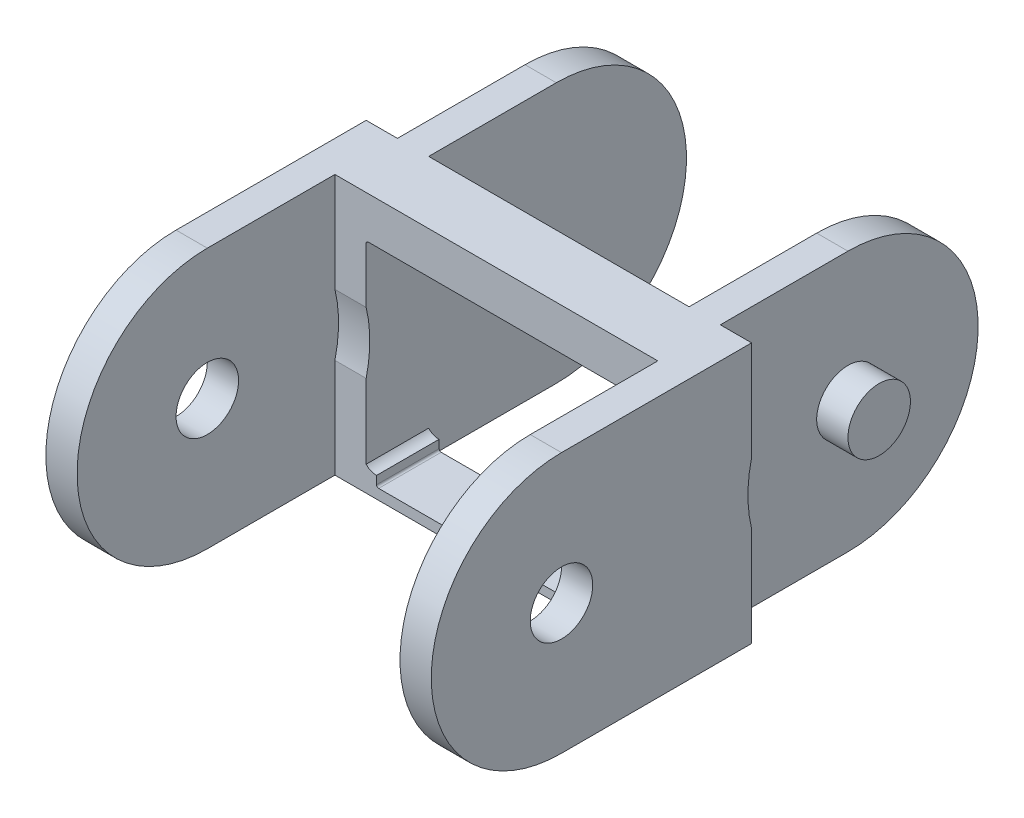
ISO-10303-21;
HEADER;
FILE_DESCRIPTION(('STEP AP214'),'2;1');
FILE_NAME('part.step','',(''),(''),'','','');
FILE_SCHEMA(('AUTOMOTIVE_DESIGN { 1 0 10303 214 1 1 1 1 }'));
ENDSEC;
DATA;
#1=APPLICATION_CONTEXT('core data for automotive mechanical design processes');
#2=APPLICATION_PROTOCOL_DEFINITION('international standard','automotive_design',2000,#1);
#3=PRODUCT_CONTEXT('',#1,'mechanical');
#4=PRODUCT('Part','Part','',(#3));
#5=PRODUCT_RELATED_PRODUCT_CATEGORY('part','',(#4));
#6=PRODUCT_DEFINITION_FORMATION('','',#4);
#7=PRODUCT_DEFINITION_CONTEXT('part definition',#1,'design');
#8=PRODUCT_DEFINITION('design','',#6,#7);
#9=PRODUCT_DEFINITION_SHAPE('','',#8);
#10=(LENGTH_UNIT() NAMED_UNIT(*) SI_UNIT(.MILLI.,.METRE.));
#11=(NAMED_UNIT(*) PLANE_ANGLE_UNIT() SI_UNIT($,.RADIAN.));
#12=(NAMED_UNIT(*) SI_UNIT($,.STERADIAN.) SOLID_ANGLE_UNIT());
#13=UNCERTAINTY_MEASURE_WITH_UNIT(LENGTH_MEASURE(1.E-05),#10,'distance_accuracy_value','');
#14=(GEOMETRIC_REPRESENTATION_CONTEXT(3) GLOBAL_UNCERTAINTY_ASSIGNED_CONTEXT((#13)) GLOBAL_UNIT_ASSIGNED_CONTEXT((#10,
#11,#12)) REPRESENTATION_CONTEXT('',''));
#15=CARTESIAN_POINT('',(0.,0.,0.));
#16=DIRECTION('',(0.,0.,1.));
#17=DIRECTION('',(1.,0.,0.));
#18=AXIS2_PLACEMENT_3D('',#15,#16,#17);
#19=CARTESIAN_POINT('',(1.99984897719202,-11.,30.5));
#20=DIRECTION('',(0.,0.,1.));
#21=DIRECTION('',(1.,0.,0.));
#22=AXIS2_PLACEMENT_3D('',#19,#20,#21);
#23=CYLINDRICAL_SURFACE('',#22,0.707);
#24=CARTESIAN_POINT('',(1.99984897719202,-11.,-12.25));
#25=DIRECTION('',(0.,0.,1.));
#26=DIRECTION('',(1.,0.,0.));
#27=AXIS2_PLACEMENT_3D('',#24,#25,#26);
#28=CIRCLE('',#27,0.707);
#29=CARTESIAN_POINT('',(1.49999999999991,-11.5,-12.25));
#30=VERTEX_POINT('',#29);
#31=CARTESIAN_POINT('',(1.4999999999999,-10.5,-12.25));
#32=VERTEX_POINT('',#31);
#33=EDGE_CURVE('E276',#30,#32,#28,.F.);
#34=ORIENTED_EDGE('',*,*,#33,.F.);
#35=DIRECTION('',(0.,0.,-1.));
#36=VECTOR('',#35,1.);
#37=CARTESIAN_POINT('',(1.49999999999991,-11.5,30.5));
#38=LINE('',#37,#36);
#39=CARTESIAN_POINT('',(1.49999999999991,-11.5,-18.25));
#40=VERTEX_POINT('',#39);
#41=EDGE_CURVE('E278',#40,#30,#38,.F.);
#42=ORIENTED_EDGE('',*,*,#41,.F.);
#43=CARTESIAN_POINT('',(1.99984897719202,-11.,-18.25));
#44=DIRECTION('',(0.,0.,1.));
#45=DIRECTION('',(1.,0.,0.));
#46=AXIS2_PLACEMENT_3D('',#43,#44,#45);
#47=CIRCLE('',#46,0.707);
#48=CARTESIAN_POINT('',(1.4999999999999,-10.5,-18.25));
#49=VERTEX_POINT('',#48);
#50=EDGE_CURVE('E19',#49,#40,#47,.T.);
#51=ORIENTED_EDGE('',*,*,#50,.F.);
#52=DIRECTION('',(0.,0.,1.));
#53=VECTOR('',#52,1.);
#54=CARTESIAN_POINT('',(1.4999999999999,-10.5,30.5));
#55=LINE('',#54,#53);
#56=EDGE_CURVE('E305',#32,#49,#55,.F.);
#57=ORIENTED_EDGE('',*,*,#56,.F.);
#58=EDGE_LOOP('',(#34,#42,#51,#57));
#59=FACE_BOUND('',#58,.T.);
#60=ADVANCED_FACE('F16',(#59),#23,.F.);
#61=CARTESIAN_POINT('',(-11.3,-11.3,30.5));
#62=DIRECTION('',(0.,0.,1.));
#63=DIRECTION('',(1.,0.,0.));
#64=AXIS2_PLACEMENT_3D('',#61,#62,#63);
#65=CYLINDRICAL_SURFACE('',#64,0.199999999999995);
#66=CARTESIAN_POINT('',(-11.3,-11.3,-12.25));
#67=DIRECTION('',(0.,0.,1.));
#68=DIRECTION('',(1.,0.,0.));
#69=AXIS2_PLACEMENT_3D('',#66,#67,#68);
#70=CIRCLE('',#69,0.199999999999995);
#71=CARTESIAN_POINT('',(-11.3,-11.5,-12.25));
#72=VERTEX_POINT('',#71);
#73=CARTESIAN_POINT('',(-11.5,-11.3,-12.25));
#74=VERTEX_POINT('',#73);
#75=EDGE_CURVE('E306',#72,#74,#70,.F.);
#76=ORIENTED_EDGE('',*,*,#75,.F.);
#77=DIRECTION('',(0.,0.,1.));
#78=VECTOR('',#77,1.);
#79=CARTESIAN_POINT('',(-11.3,-11.5,30.5));
#80=LINE('',#79,#78);
#81=CARTESIAN_POINT('',(-11.3,-11.5,-18.25));
#82=VERTEX_POINT('',#81);
#83=EDGE_CURVE('E538',#82,#72,#80,.T.);
#84=ORIENTED_EDGE('',*,*,#83,.F.);
#85=CARTESIAN_POINT('',(-11.3,-11.3,-18.25));
#86=DIRECTION('',(0.,0.,1.));
#87=DIRECTION('',(1.,0.,0.));
#88=AXIS2_PLACEMENT_3D('',#85,#86,#87);
#89=CIRCLE('',#88,0.199999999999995);
#90=CARTESIAN_POINT('',(-11.5,-11.3,-18.25));
#91=VERTEX_POINT('',#90);
#92=EDGE_CURVE('E463',#91,#82,#89,.T.);
#93=ORIENTED_EDGE('',*,*,#92,.F.);
#94=DIRECTION('',(0.,0.,-1.));
#95=VECTOR('',#94,1.);
#96=CARTESIAN_POINT('',(-11.5,-11.3,30.5));
#97=LINE('',#96,#95);
#98=EDGE_CURVE('E288',#74,#91,#97,.T.);
#99=ORIENTED_EDGE('',*,*,#98,.F.);
#100=EDGE_LOOP('',(#76,#84,#93,#99));
#101=FACE_BOUND('',#100,.T.);
#102=ADVANCED_FACE('F675',(#101),#65,.F.);
#103=CARTESIAN_POINT('',(0.,-10.5,30.5));
#104=DIRECTION('',(0.,1.,0.));
#105=DIRECTION('',(0.,0.,1.));
#106=AXIS2_PLACEMENT_3D('',#103,#104,#105);
#107=PLANE('',#106);
#108=ORIENTED_EDGE('',*,*,#56,.T.);
#109=DIRECTION('',(1.,0.,0.));
#110=VECTOR('',#109,1.);
#111=CARTESIAN_POINT('',(0.,-10.5,-18.25));
#112=LINE('',#111,#110);
#113=CARTESIAN_POINT('',(0.,-10.5,-18.25));
#114=VERTEX_POINT('',#113);
#115=EDGE_CURVE('E274',#49,#114,#112,.F.);
#116=ORIENTED_EDGE('',*,*,#115,.T.);
#117=DIRECTION('',(0.,0.,1.));
#118=VECTOR('',#117,1.);
#119=CARTESIAN_POINT('',(0.,-10.5,30.5));
#120=LINE('',#119,#118);
#121=CARTESIAN_POINT('',(0.,-10.5,-12.25));
#122=VERTEX_POINT('',#121);
#123=EDGE_CURVE('E474',#122,#114,#120,.F.);
#124=ORIENTED_EDGE('',*,*,#123,.F.);
#125=DIRECTION('',(1.,0.,0.));
#126=VECTOR('',#125,1.);
#127=CARTESIAN_POINT('',(0.,-10.5,-12.25));
#128=LINE('',#127,#126);
#129=EDGE_CURVE('E302',#122,#32,#128,.T.);
#130=ORIENTED_EDGE('',*,*,#129,.T.);
#131=EDGE_LOOP('',(#108,#116,#124,#130));
#132=FACE_BOUND('',#131,.T.);
#133=ADVANCED_FACE('F472',(#132),#107,.T.);
#134=CARTESIAN_POINT('',(1.4999999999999,-11.5,30.5));
#135=DIRECTION('',(0.,-1.,0.));
#136=DIRECTION('',(0.,0.,-1.));
#137=AXIS2_PLACEMENT_3D('',#134,#135,#136);
#138=PLANE('',#137);
#139=DIRECTION('',(0.,0.,1.));
#140=VECTOR('',#139,1.);
#141=CARTESIAN_POINT('',(0.,-11.5,30.5));
#142=LINE('',#141,#140);
#143=CARTESIAN_POINT('',(0.,-11.5,-18.25));
#144=VERTEX_POINT('',#143);
#145=CARTESIAN_POINT('',(0.,-11.5,-12.25));
#146=VERTEX_POINT('',#145);
#147=EDGE_CURVE('E286',#144,#146,#142,.T.);
#148=ORIENTED_EDGE('',*,*,#147,.F.);
#149=DIRECTION('',(1.,0.,0.));
#150=VECTOR('',#149,1.);
#151=CARTESIAN_POINT('',(1.4999999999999,-11.5,-18.25));
#152=LINE('',#151,#150);
#153=EDGE_CURVE('E270',#144,#40,#152,.T.);
#154=ORIENTED_EDGE('',*,*,#153,.T.);
#155=ORIENTED_EDGE('',*,*,#41,.T.);
#156=DIRECTION('',(1.,0.,0.));
#157=VECTOR('',#156,1.);
#158=CARTESIAN_POINT('',(1.4999999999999,-11.5,-12.25));
#159=LINE('',#158,#157);
#160=EDGE_CURVE('E282',#30,#146,#159,.F.);
#161=ORIENTED_EDGE('',*,*,#160,.T.);
#162=EDGE_LOOP('',(#148,#154,#155,#161));
#163=FACE_BOUND('',#162,.T.);
#164=ADVANCED_FACE('F284',(#163),#138,.T.);
#165=CARTESIAN_POINT('',(-18.5,0.,-30.5));
#166=DIRECTION('',(1.,0.,0.));
#167=DIRECTION('',(0.,0.,-1.));
#168=AXIS2_PLACEMENT_3D('',#165,#166,#167);
#169=PLANE('',#168);
#170=CARTESIAN_POINT('',(-18.5,0.,-30.5));
#171=DIRECTION('',(1.,0.,0.));
#172=DIRECTION('',(0.,0.,-1.));
#173=AXIS2_PLACEMENT_3D('',#170,#171,#172);
#174=CIRCLE('',#173,3.);
#175=CARTESIAN_POINT('',(-18.5,0.,-33.5));
#176=VERTEX_POINT('',#175);
#177=EDGE_CURVE('E443',#176,#176,#174,.T.);
#178=ORIENTED_EDGE('',*,*,#177,.F.);
#179=EDGE_LOOP('',(#178));
#180=FACE_BOUND('',#179,.T.);
#181=ADVANCED_FACE('F866',(#180),#169,.F.);
#182=CARTESIAN_POINT('',(-11.5,-10.519,30.5));
#183=DIRECTION('',(1.,0.,0.));
#184=DIRECTION('',(0.,0.,-1.));
#185=AXIS2_PLACEMENT_3D('',#182,#183,#184);
#186=PLANE('',#185);
#187=ORIENTED_EDGE('',*,*,#98,.T.);
#188=DIRECTION('',(0.,1.,0.));
#189=VECTOR('',#188,1.);
#190=CARTESIAN_POINT('',(-11.5,-10.519,-18.25));
#191=LINE('',#190,#189);
#192=CARTESIAN_POINT('',(-11.5,-10.519,-18.25));
#193=VERTEX_POINT('',#192);
#194=EDGE_CURVE('E291',#91,#193,#191,.T.);
#195=ORIENTED_EDGE('',*,*,#194,.T.);
#196=DIRECTION('',(0.,0.,1.));
#197=VECTOR('',#196,1.);
#198=CARTESIAN_POINT('',(-11.5,-10.519,30.5));
#199=LINE('',#198,#197);
#200=CARTESIAN_POINT('',(-11.5,-10.519,-12.25));
#201=VERTEX_POINT('',#200);
#202=EDGE_CURVE('E437',#193,#201,#199,.T.);
#203=ORIENTED_EDGE('',*,*,#202,.T.);
#204=DIRECTION('',(0.,1.,0.));
#205=VECTOR('',#204,1.);
#206=CARTESIAN_POINT('',(-11.5,-12.5,-12.25));
#207=LINE('',#206,#205);
#208=EDGE_CURVE('E489',#74,#201,#207,.T.);
#209=ORIENTED_EDGE('',*,*,#208,.F.);
#210=EDGE_LOOP('',(#187,#195,#203,#209));
#211=FACE_BOUND('',#210,.T.);
#212=ADVANCED_FACE('F550',(#211),#186,.T.);
#213=CARTESIAN_POINT('',(-11.3,-11.5,30.5));
#214=DIRECTION('',(0.,1.,0.));
#215=DIRECTION('',(0.,0.,1.));
#216=AXIS2_PLACEMENT_3D('',#213,#214,#215);
#217=PLANE('',#216);
#218=DIRECTION('',(0.,0.,1.));
#219=VECTOR('',#218,1.);
#220=CARTESIAN_POINT('',(-1.5,-11.5,30.5));
#221=LINE('',#220,#219);
#222=CARTESIAN_POINT('',(-1.5,-11.5,-18.25));
#223=VERTEX_POINT('',#222);
#224=CARTESIAN_POINT('',(-1.5,-11.5,-12.25));
#225=VERTEX_POINT('',#224);
#226=EDGE_CURVE('E479',#223,#225,#221,.T.);
#227=ORIENTED_EDGE('',*,*,#226,.F.);
#228=DIRECTION('',(-1.,0.,0.));
#229=VECTOR('',#228,1.);
#230=CARTESIAN_POINT('',(12.5,-11.5,-18.25));
#231=LINE('',#230,#229);
#232=EDGE_CURVE('E434',#82,#223,#231,.F.);
#233=ORIENTED_EDGE('',*,*,#232,.F.);
#234=ORIENTED_EDGE('',*,*,#83,.T.);
#235=DIRECTION('',(1.,0.,0.));
#236=VECTOR('',#235,1.);
#237=CARTESIAN_POINT('',(15.5,-11.5,-12.25));
#238=LINE('',#237,#236);
#239=EDGE_CURVE('E487',#225,#72,#238,.F.);
#240=ORIENTED_EDGE('',*,*,#239,.F.);
#241=EDGE_LOOP('',(#227,#233,#234,#240));
#242=FACE_BOUND('',#241,.T.);
#243=ADVANCED_FACE('F672',(#242),#217,.T.);
#244=CARTESIAN_POINT('',(-1.5,-11.5,30.5));
#245=DIRECTION('',(-0.554700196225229,0.832050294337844,0.));
#246=DIRECTION('',(-0.832050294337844,-0.554700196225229,0.));
#247=AXIS2_PLACEMENT_3D('',#244,#245,#246);
#248=PLANE('',#247);
#249=ORIENTED_EDGE('',*,*,#123,.T.);
#250=DIRECTION('',(0.832050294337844,0.554700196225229,0.));
#251=VECTOR('',#250,1.);
#252=CARTESIAN_POINT('',(-1.5,-11.5,-18.25));
#253=LINE('',#252,#251);
#254=EDGE_CURVE('E525',#223,#114,#253,.T.);
#255=ORIENTED_EDGE('',*,*,#254,.F.);
#256=ORIENTED_EDGE('',*,*,#226,.T.);
#257=DIRECTION('',(-0.832050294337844,-0.554700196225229,0.));
#258=VECTOR('',#257,1.);
#259=CARTESIAN_POINT('',(0.,-10.5,-12.25));
#260=LINE('',#259,#258);
#261=EDGE_CURVE('E482',#122,#225,#260,.T.);
#262=ORIENTED_EDGE('',*,*,#261,.F.);
#263=EDGE_LOOP('',(#249,#255,#256,#262));
#264=FACE_BOUND('',#263,.T.);
#265=ADVANCED_FACE('F483',(#264),#248,.T.);
#266=CARTESIAN_POINT('',(0.,-11.5,30.5));
#267=DIRECTION('',(0.554700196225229,-0.832050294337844,0.));
#268=DIRECTION('',(0.832050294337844,0.554700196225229,0.));
#269=AXIS2_PLACEMENT_3D('',#266,#267,#268);
#270=PLANE('',#269);
#271=DIRECTION('',(0.,0.,1.));
#272=VECTOR('',#271,1.);
#273=CARTESIAN_POINT('',(-1.5,-12.5,0.));
#274=LINE('',#273,#272);
#275=CARTESIAN_POINT('',(-1.5,-12.5,-12.25));
#276=VERTEX_POINT('',#275);
#277=CARTESIAN_POINT('',(-1.5,-12.5,-18.25));
#278=VERTEX_POINT('',#277);
#279=EDGE_CURVE('E515',#276,#278,#274,.F.);
#280=ORIENTED_EDGE('',*,*,#279,.T.);
#281=DIRECTION('',(-0.832050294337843,-0.55470019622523,0.));
#282=VECTOR('',#281,1.);
#283=CARTESIAN_POINT('',(0.,-11.5,-18.25));
#284=LINE('',#283,#282);
#285=EDGE_CURVE('E523',#144,#278,#284,.T.);
#286=ORIENTED_EDGE('',*,*,#285,.F.);
#287=ORIENTED_EDGE('',*,*,#147,.T.);
#288=DIRECTION('',(0.832050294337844,0.554700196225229,0.));
#289=VECTOR('',#288,1.);
#290=CARTESIAN_POINT('',(-1.5,-12.5,-12.25));
#291=LINE('',#290,#289);
#292=EDGE_CURVE('E440',#276,#146,#291,.T.);
#293=ORIENTED_EDGE('',*,*,#292,.F.);
#294=EDGE_LOOP('',(#280,#286,#287,#293));
#295=FACE_BOUND('',#294,.T.);
#296=ADVANCED_FACE('F855',(#295),#270,.T.);
#297=CARTESIAN_POINT('',(11.5,-11.442,30.5));
#298=DIRECTION('',(-1.,0.,0.));
#299=DIRECTION('',(0.,0.,1.));
#300=AXIS2_PLACEMENT_3D('',#297,#298,#299);
#301=PLANE('',#300);
#302=DIRECTION('',(0.,0.,1.));
#303=VECTOR('',#302,1.);
#304=CARTESIAN_POINT('',(11.5,-10.52,30.5));
#305=LINE('',#304,#303);
#306=CARTESIAN_POINT('',(11.5,-10.52,-12.25));
#307=VERTEX_POINT('',#306);
#308=CARTESIAN_POINT('',(11.5,-10.52,-18.25));
#309=VERTEX_POINT('',#308);
#310=EDGE_CURVE('E429',#307,#309,#305,.F.);
#311=ORIENTED_EDGE('',*,*,#310,.T.);
#312=DIRECTION('',(0.,1.,0.));
#313=VECTOR('',#312,1.);
#314=CARTESIAN_POINT('',(11.5,-11.442,-18.25));
#315=LINE('',#314,#313);
#316=CARTESIAN_POINT('',(11.5,-11.442,-18.25));
#317=VERTEX_POINT('',#316);
#318=EDGE_CURVE('E461',#309,#317,#315,.F.);
#319=ORIENTED_EDGE('',*,*,#318,.T.);
#320=DIRECTION('',(0.,0.,1.));
#321=VECTOR('',#320,1.);
#322=CARTESIAN_POINT('',(11.5,-11.442,30.5));
#323=LINE('',#322,#321);
#324=CARTESIAN_POINT('',(11.5,-11.442,-12.25));
#325=VERTEX_POINT('',#324);
#326=EDGE_CURVE('E296',#317,#325,#323,.T.);
#327=ORIENTED_EDGE('',*,*,#326,.T.);
#328=DIRECTION('',(0.,1.,0.));
#329=VECTOR('',#328,1.);
#330=CARTESIAN_POINT('',(11.5,-11.442,-12.25));
#331=LINE('',#330,#329);
#332=EDGE_CURVE('E519',#325,#307,#331,.T.);
#333=ORIENTED_EDGE('',*,*,#332,.T.);
#334=EDGE_LOOP('',(#311,#319,#327,#333));
#335=FACE_BOUND('',#334,.T.);
#336=ADVANCED_FACE('F851',(#335),#301,.T.);
#337=CARTESIAN_POINT('',(1.60219020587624,-11.392,30.5));
#338=DIRECTION('',(0.,0.,1.));
#339=DIRECTION('',(1.,0.,0.));
#340=AXIS2_PLACEMENT_3D('',#337,#338,#339);
#341=CYLINDRICAL_SURFACE('',#340,0.250000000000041);
#342=CARTESIAN_POINT('',(1.60219020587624,-11.392,-12.25));
#343=DIRECTION('',(0.,0.,1.));
#344=DIRECTION('',(1.,0.,0.));
#345=AXIS2_PLACEMENT_3D('',#342,#343,#344);
#346=CIRCLE('',#345,0.250000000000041);
#347=CARTESIAN_POINT('',(1.60219025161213,-11.642,-12.25));
#348=VERTEX_POINT('',#347);
#349=CARTESIAN_POINT('',(1.44700000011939,-11.5880000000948,-12.25));
#350=VERTEX_POINT('',#349);
#351=EDGE_CURVE('E457',#348,#350,#346,.F.);
#352=ORIENTED_EDGE('',*,*,#351,.F.);
#353=DIRECTION('',(0.,0.,1.));
#354=VECTOR('',#353,1.);
#355=CARTESIAN_POINT('',(1.60219029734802,-11.642,30.5));
#356=LINE('',#355,#354);
#357=CARTESIAN_POINT('',(1.60219025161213,-11.642,-18.25));
#358=VERTEX_POINT('',#357);
#359=EDGE_CURVE('E634',#358,#348,#356,.T.);
#360=ORIENTED_EDGE('',*,*,#359,.F.);
#361=CARTESIAN_POINT('',(1.60219020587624,-11.392,-18.25));
#362=DIRECTION('',(0.,0.,1.));
#363=DIRECTION('',(1.,0.,0.));
#364=AXIS2_PLACEMENT_3D('',#361,#362,#363);
#365=CIRCLE('',#364,0.250000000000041);
#366=CARTESIAN_POINT('',(1.44700000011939,-11.5880000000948,-18.25));
#367=VERTEX_POINT('',#366);
#368=EDGE_CURVE('E459',#367,#358,#365,.T.);
#369=ORIENTED_EDGE('',*,*,#368,.F.);
#370=DIRECTION('',(0.,0.,1.));
#371=VECTOR('',#370,1.);
#372=CARTESIAN_POINT('',(1.44700000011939,-11.5880000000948,30.5));
#373=LINE('',#372,#371);
#374=EDGE_CURVE('E450',#350,#367,#373,.F.);
#375=ORIENTED_EDGE('',*,*,#374,.F.);
#376=EDGE_LOOP('',(#352,#360,#369,#375));
#377=FACE_BOUND('',#376,.T.);
#378=ADVANCED_FACE('F847',(#377),#341,.F.);
#379=CARTESIAN_POINT('',(11.3,-11.442,30.5));
#380=DIRECTION('',(0.,0.,1.));
#381=DIRECTION('',(1.,0.,0.));
#382=AXIS2_PLACEMENT_3D('',#379,#380,#381);
#383=CYLINDRICAL_SURFACE('',#382,0.199999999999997);
#384=CARTESIAN_POINT('',(11.3,-11.442,-12.25));
#385=DIRECTION('',(0.,0.,1.));
#386=DIRECTION('',(1.,0.,0.));
#387=AXIS2_PLACEMENT_3D('',#384,#385,#386);
#388=CIRCLE('',#387,0.199999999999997);
#389=CARTESIAN_POINT('',(11.3,-11.642,-12.25));
#390=VERTEX_POINT('',#389);
#391=EDGE_CURVE('E453',#325,#390,#388,.F.);
#392=ORIENTED_EDGE('',*,*,#391,.F.);
#393=ORIENTED_EDGE('',*,*,#326,.F.);
#394=CARTESIAN_POINT('',(11.3,-11.442,-18.25));
#395=DIRECTION('',(0.,0.,1.));
#396=DIRECTION('',(1.,0.,0.));
#397=AXIS2_PLACEMENT_3D('',#394,#395,#396);
#398=CIRCLE('',#397,0.199999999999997);
#399=CARTESIAN_POINT('',(11.3,-11.642,-18.25));
#400=VERTEX_POINT('',#399);
#401=EDGE_CURVE('E455',#400,#317,#398,.T.);
#402=ORIENTED_EDGE('',*,*,#401,.F.);
#403=DIRECTION('',(0.,0.,1.));
#404=VECTOR('',#403,1.);
#405=CARTESIAN_POINT('',(11.3,-11.642,30.5));
#406=LINE('',#405,#404);
#407=EDGE_CURVE('E637',#390,#400,#406,.F.);
#408=ORIENTED_EDGE('',*,*,#407,.F.);
#409=EDGE_LOOP('',(#392,#393,#402,#408));
#410=FACE_BOUND('',#409,.T.);
#411=ADVANCED_FACE('F844',(#410),#383,.F.);
#412=CARTESIAN_POINT('',(1.250095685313,-11.8351531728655,30.5));
#413=DIRECTION('',(0.,0.,1.));
#414=DIRECTION('',(1.,0.,0.));
#415=AXIS2_PLACEMENT_3D('',#412,#413,#414);
#416=CYLINDRICAL_SURFACE('',#415,0.316);
#417=CARTESIAN_POINT('',(1.250095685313,-11.8351531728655,-12.25));
#418=DIRECTION('',(0.,0.,1.));
#419=DIRECTION('',(1.,0.,0.));
#420=AXIS2_PLACEMENT_3D('',#417,#418,#419);
#421=CIRCLE('',#420,0.316);
#422=CARTESIAN_POINT('',(1.,-11.6420000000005,-12.25));
#423=VERTEX_POINT('',#422);
#424=EDGE_CURVE('E447',#423,#350,#421,.F.);
#425=ORIENTED_EDGE('',*,*,#424,.T.);
#426=ORIENTED_EDGE('',*,*,#374,.T.);
#427=CARTESIAN_POINT('',(1.250095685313,-11.8351531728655,-18.25));
#428=DIRECTION('',(0.,0.,1.));
#429=DIRECTION('',(1.,0.,0.));
#430=AXIS2_PLACEMENT_3D('',#427,#428,#429);
#431=CIRCLE('',#430,0.316);
#432=CARTESIAN_POINT('',(1.,-11.6420000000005,-18.25));
#433=VERTEX_POINT('',#432);
#434=EDGE_CURVE('E451',#367,#433,#431,.T.);
#435=ORIENTED_EDGE('',*,*,#434,.T.);
#436=DIRECTION('',(0.,0.,1.));
#437=VECTOR('',#436,1.);
#438=CARTESIAN_POINT('',(1.,-11.6420000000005,30.5));
#439=LINE('',#438,#437);
#440=EDGE_CURVE('E426',#423,#433,#439,.F.);
#441=ORIENTED_EDGE('',*,*,#440,.F.);
#442=EDGE_LOOP('',(#425,#426,#435,#441));
#443=FACE_BOUND('',#442,.T.);
#444=ADVANCED_FACE('F840',(#443),#416,.T.);
#445=CARTESIAN_POINT('',(18.5,0.,-30.5));
#446=DIRECTION('',(1.,0.,0.));
#447=DIRECTION('',(0.,0.,-1.));
#448=AXIS2_PLACEMENT_3D('',#445,#446,#447);
#449=PLANE('',#448);
#450=CARTESIAN_POINT('',(18.5,0.,-30.5));
#451=DIRECTION('',(1.,0.,0.));
#452=DIRECTION('',(0.,0.,-1.));
#453=AXIS2_PLACEMENT_3D('',#450,#451,#452);
#454=CIRCLE('',#453,3.);
#455=CARTESIAN_POINT('',(18.5,0.,-33.5));
#456=VERTEX_POINT('',#455);
#457=EDGE_CURVE('E423',#456,#456,#454,.F.);
#458=ORIENTED_EDGE('',*,*,#457,.F.);
#459=EDGE_LOOP('',(#458));
#460=FACE_BOUND('',#459,.T.);
#461=ADVANCED_FACE('F836',(#460),#449,.T.);
#462=CARTESIAN_POINT('',(18.5,0.,0.));
#463=DIRECTION('',(1.,0.,0.));
#464=DIRECTION('',(0.,0.,-1.));
#465=AXIS2_PLACEMENT_3D('',#462,#463,#464);
#466=CYLINDRICAL_SURFACE('',#465,3.);
#467=CARTESIAN_POINT('',(-15.5,0.,0.));
#468=DIRECTION('',(1.,0.,0.));
#469=DIRECTION('',(0.,0.,-1.));
#470=AXIS2_PLACEMENT_3D('',#467,#468,#469);
#471=CIRCLE('',#470,3.);
#472=CARTESIAN_POINT('',(-15.5,0.,-3.));
#473=VERTEX_POINT('',#472);
#474=EDGE_CURVE('E419',#473,#473,#471,.F.);
#475=ORIENTED_EDGE('',*,*,#474,.F.);
#476=EDGE_LOOP('',(#475));
#477=FACE_BOUND('',#476,.T.);
#478=CARTESIAN_POINT('',(-18.5,0.,0.));
#479=DIRECTION('',(1.,0.,0.));
#480=DIRECTION('',(0.,0.,-1.));
#481=AXIS2_PLACEMENT_3D('',#478,#479,#480);
#482=CIRCLE('',#481,3.);
#483=CARTESIAN_POINT('',(-18.5,0.,-3.));
#484=VERTEX_POINT('',#483);
#485=EDGE_CURVE('E408',#484,#484,#482,.F.);
#486=ORIENTED_EDGE('',*,*,#485,.T.);
#487=EDGE_LOOP('',(#486));
#488=FACE_BOUND('',#487,.T.);
#489=ADVANCED_FACE('F833',(#477,#488),#466,.F.);
#490=CARTESIAN_POINT('',(18.5,0.,-30.5));
#491=DIRECTION('',(1.,0.,0.));
#492=DIRECTION('',(0.,0.,-1.));
#493=AXIS2_PLACEMENT_3D('',#490,#491,#492);
#494=CYLINDRICAL_SURFACE('',#493,12.6);
#495=CARTESIAN_POINT('',(-15.5,0.,-30.5));
#496=DIRECTION('',(1.,0.,0.));
#497=DIRECTION('',(0.,0.,-1.));
#498=AXIS2_PLACEMENT_3D('',#495,#496,#497);
#499=CIRCLE('',#498,12.6);
#500=CARTESIAN_POINT('',(-15.5,2.94915242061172,-18.25));
#501=VERTEX_POINT('',#500);
#502=CARTESIAN_POINT('',(-15.5,-2.94915242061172,-18.25));
#503=VERTEX_POINT('',#502);
#504=EDGE_CURVE('E396',#501,#503,#499,.T.);
#505=ORIENTED_EDGE('',*,*,#504,.T.);
#506=DIRECTION('',(1.,0.,0.));
#507=VECTOR('',#506,1.);
#508=CARTESIAN_POINT('',(18.5,-2.94915242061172,-18.25));
#509=LINE('',#508,#507);
#510=CARTESIAN_POINT('',(-18.5,-2.94915242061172,-18.25));
#511=VERTEX_POINT('',#510);
#512=EDGE_CURVE('E446',#503,#511,#509,.F.);
#513=ORIENTED_EDGE('',*,*,#512,.T.);
#514=CARTESIAN_POINT('',(-18.5,0.,-30.5));
#515=DIRECTION('',(1.,0.,0.));
#516=DIRECTION('',(0.,0.,-1.));
#517=AXIS2_PLACEMENT_3D('',#514,#515,#516);
#518=CIRCLE('',#517,12.6);
#519=CARTESIAN_POINT('',(-18.5,2.94915242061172,-18.25));
#520=VERTEX_POINT('',#519);
#521=EDGE_CURVE('E400',#511,#520,#518,.F.);
#522=ORIENTED_EDGE('',*,*,#521,.T.);
#523=DIRECTION('',(1.,0.,0.));
#524=VECTOR('',#523,1.);
#525=CARTESIAN_POINT('',(18.5,2.94915242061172,-18.25));
#526=LINE('',#525,#524);
#527=EDGE_CURVE('E508',#520,#501,#526,.T.);
#528=ORIENTED_EDGE('',*,*,#527,.T.);
#529=EDGE_LOOP('',(#505,#513,#522,#528));
#530=FACE_BOUND('',#529,.T.);
#531=ADVANCED_FACE('F830',(#530),#494,.F.);
#532=CARTESIAN_POINT('',(18.5,-12.5,-18.25));
#533=DIRECTION('',(0.,0.,1.));
#534=DIRECTION('',(1.,0.,0.));
#535=AXIS2_PLACEMENT_3D('',#532,#533,#534);
#536=PLANE('',#535);
#537=DIRECTION('',(1.,0.,0.));
#538=VECTOR('',#537,1.);
#539=CARTESIAN_POINT('',(18.5,-12.5,-18.25));
#540=LINE('',#539,#538);
#541=CARTESIAN_POINT('',(-15.5,-12.5,-18.25));
#542=VERTEX_POINT('',#541);
#543=CARTESIAN_POINT('',(-18.5,-12.5,-18.25));
#544=VERTEX_POINT('',#543);
#545=EDGE_CURVE('E516',#542,#544,#540,.F.);
#546=ORIENTED_EDGE('',*,*,#545,.T.);
#547=DIRECTION('',(0.,1.,0.));
#548=VECTOR('',#547,1.);
#549=CARTESIAN_POINT('',(-18.5,0.,-18.25));
#550=LINE('',#549,#548);
#551=EDGE_CURVE('E403',#544,#511,#550,.T.);
#552=ORIENTED_EDGE('',*,*,#551,.T.);
#553=ORIENTED_EDGE('',*,*,#512,.F.);
#554=DIRECTION('',(0.,1.,0.));
#555=VECTOR('',#554,1.);
#556=CARTESIAN_POINT('',(-15.5,0.,-18.25));
#557=LINE('',#556,#555);
#558=EDGE_CURVE('E398',#503,#542,#557,.F.);
#559=ORIENTED_EDGE('',*,*,#558,.T.);
#560=EDGE_LOOP('',(#546,#552,#553,#559));
#561=FACE_BOUND('',#560,.T.);
#562=ADVANCED_FACE('F587',(#561),#536,.F.);
#563=CARTESIAN_POINT('',(18.5,0.,-30.5));
#564=DIRECTION('',(1.,0.,0.));
#565=DIRECTION('',(0.,0.,-1.));
#566=AXIS2_PLACEMENT_3D('',#563,#564,#565);
#567=CYLINDRICAL_SURFACE('',#566,3.);
#568=CARTESIAN_POINT('',(-15.5,0.,-30.5));
#569=DIRECTION('',(1.,0.,0.));
#570=DIRECTION('',(0.,0.,-1.));
#571=AXIS2_PLACEMENT_3D('',#568,#569,#570);
#572=CIRCLE('',#571,3.);
#573=CARTESIAN_POINT('',(-15.5,0.,-33.5));
#574=VERTEX_POINT('',#573);
#575=EDGE_CURVE('E392',#574,#574,#572,.F.);
#576=ORIENTED_EDGE('',*,*,#575,.T.);
#577=EDGE_LOOP('',(#576));
#578=FACE_BOUND('',#577,.T.);
#579=ORIENTED_EDGE('',*,*,#177,.T.);
#580=EDGE_LOOP('',(#579));
#581=FACE_BOUND('',#580,.T.);
#582=ADVANCED_FACE('F823',(#578,#581),#567,.T.);
#583=CARTESIAN_POINT('',(-12.3,8.28,30.5));
#584=DIRECTION('',(0.,0.,1.));
#585=DIRECTION('',(1.,0.,0.));
#586=AXIS2_PLACEMENT_3D('',#583,#584,#585);
#587=CYLINDRICAL_SURFACE('',#586,0.2);
#588=CARTESIAN_POINT('',(-12.3,8.28,-12.25));
#589=DIRECTION('',(0.,0.,1.));
#590=DIRECTION('',(1.,0.,0.));
#591=AXIS2_PLACEMENT_3D('',#588,#589,#590);
#592=CIRCLE('',#591,0.2);
#593=CARTESIAN_POINT('',(-12.5,8.28,-12.25));
#594=VERTEX_POINT('',#593);
#595=CARTESIAN_POINT('',(-12.3,8.48,-12.25));
#596=VERTEX_POINT('',#595);
#597=EDGE_CURVE('E438',#594,#596,#592,.F.);
#598=ORIENTED_EDGE('',*,*,#597,.F.);
#599=DIRECTION('',(0.,0.,-1.));
#600=VECTOR('',#599,1.);
#601=CARTESIAN_POINT('',(-12.5,8.28,-30.5));
#602=LINE('',#601,#600);
#603=CARTESIAN_POINT('',(-12.5,8.28,-18.25));
#604=VERTEX_POINT('',#603);
#605=EDGE_CURVE('E387',#604,#594,#602,.F.);
#606=ORIENTED_EDGE('',*,*,#605,.F.);
#607=CARTESIAN_POINT('',(-12.3,8.28,-18.25));
#608=DIRECTION('',(0.,0.,1.));
#609=DIRECTION('',(1.,0.,0.));
#610=AXIS2_PLACEMENT_3D('',#607,#608,#609);
#611=CIRCLE('',#610,0.2);
#612=CARTESIAN_POINT('',(-12.3,8.48,-18.25));
#613=VERTEX_POINT('',#612);
#614=EDGE_CURVE('E441',#613,#604,#611,.T.);
#615=ORIENTED_EDGE('',*,*,#614,.F.);
#616=DIRECTION('',(0.,0.,-1.));
#617=VECTOR('',#616,1.);
#618=CARTESIAN_POINT('',(-12.3,8.48,30.5));
#619=LINE('',#618,#617);
#620=EDGE_CURVE('E430',#596,#613,#619,.T.);
#621=ORIENTED_EDGE('',*,*,#620,.F.);
#622=EDGE_LOOP('',(#598,#606,#615,#621));
#623=FACE_BOUND('',#622,.T.);
#624=ADVANCED_FACE('F820',(#623),#587,.F.);
#625=CARTESIAN_POINT('',(15.5,-12.5,-12.25));
#626=DIRECTION('',(0.,0.,1.));
#627=DIRECTION('',(1.,0.,0.));
#628=AXIS2_PLACEMENT_3D('',#625,#626,#627);
#629=PLANE('',#628);
#630=ORIENTED_EDGE('',*,*,#75,.T.);
#631=ORIENTED_EDGE('',*,*,#208,.T.);
#632=CARTESIAN_POINT('',(-11.549733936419,-9.25297648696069,-12.25));
#633=DIRECTION('',(0.,0.,1.));
#634=DIRECTION('',(1.,0.,0.));
#635=AXIS2_PLACEMENT_3D('',#632,#633,#634);
#636=CIRCLE('',#635,1.267);
#637=CARTESIAN_POINT('',(-12.5,-10.0909999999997,-12.25));
#638=VERTEX_POINT('',#637);
#639=EDGE_CURVE('E435',#201,#638,#636,.F.);
#640=ORIENTED_EDGE('',*,*,#639,.T.);
#641=DIRECTION('',(0.,1.,0.));
#642=VECTOR('',#641,1.);
#643=CARTESIAN_POINT('',(-12.5,0.,-12.25));
#644=LINE('',#643,#642);
#645=CARTESIAN_POINT('',(-12.5,-2.94915242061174,-12.25));
#646=VERTEX_POINT('',#645);
#647=EDGE_CURVE('E386',#646,#638,#644,.F.);
#648=ORIENTED_EDGE('',*,*,#647,.F.);
#649=DIRECTION('',(1.,0.,0.));
#650=VECTOR('',#649,1.);
#651=CARTESIAN_POINT('',(15.5,-2.94915242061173,-12.25));
#652=LINE('',#651,#650);
#653=CARTESIAN_POINT('',(-15.5,-2.94915242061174,-12.25));
#654=VERTEX_POINT('',#653);
#655=EDGE_CURVE('E581',#646,#654,#652,.F.);
#656=ORIENTED_EDGE('',*,*,#655,.T.);
#657=DIRECTION('',(0.,1.,0.));
#658=VECTOR('',#657,1.);
#659=CARTESIAN_POINT('',(-15.5,0.,-12.25));
#660=LINE('',#659,#658);
#661=CARTESIAN_POINT('',(-15.5,-12.5,-12.25));
#662=VERTEX_POINT('',#661);
#663=EDGE_CURVE('E418',#662,#654,#660,.T.);
#664=ORIENTED_EDGE('',*,*,#663,.F.);
#665=DIRECTION('',(1.,0.,0.));
#666=VECTOR('',#665,1.);
#667=CARTESIAN_POINT('',(18.5,-12.5,-12.25));
#668=LINE('',#667,#666);
#669=EDGE_CURVE('E512',#662,#276,#668,.T.);
#670=ORIENTED_EDGE('',*,*,#669,.T.);
#671=ORIENTED_EDGE('',*,*,#292,.T.);
#672=ORIENTED_EDGE('',*,*,#160,.F.);
#673=ORIENTED_EDGE('',*,*,#33,.T.);
#674=ORIENTED_EDGE('',*,*,#129,.F.);
#675=ORIENTED_EDGE('',*,*,#261,.T.);
#676=ORIENTED_EDGE('',*,*,#239,.T.);
#677=EDGE_LOOP('',(#630,#631,#640,#648,#656,#664,#670,#671,#672,#673,#674,#675,#676));
#678=FACE_BOUND('',#677,.T.);
#679=ADVANCED_FACE('F466',(#678),#629,.T.);
#680=CARTESIAN_POINT('',(-11.549733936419,-9.25297648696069,30.5));
#681=DIRECTION('',(0.,0.,1.));
#682=DIRECTION('',(1.,0.,0.));
#683=AXIS2_PLACEMENT_3D('',#680,#681,#682);
#684=CYLINDRICAL_SURFACE('',#683,1.267);
#685=ORIENTED_EDGE('',*,*,#639,.F.);
#686=ORIENTED_EDGE('',*,*,#202,.F.);
#687=CARTESIAN_POINT('',(-11.549733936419,-9.25297648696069,-18.25));
#688=DIRECTION('',(0.,0.,1.));
#689=DIRECTION('',(1.,0.,0.));
#690=AXIS2_PLACEMENT_3D('',#687,#688,#689);
#691=CIRCLE('',#690,1.267);
#692=CARTESIAN_POINT('',(-12.5,-10.0909999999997,-18.25));
#693=VERTEX_POINT('',#692);
#694=EDGE_CURVE('E431',#693,#193,#691,.T.);
#695=ORIENTED_EDGE('',*,*,#694,.F.);
#696=DIRECTION('',(0.,0.,-1.));
#697=VECTOR('',#696,1.);
#698=CARTESIAN_POINT('',(-12.5,-10.0909999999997,-30.5));
#699=LINE('',#698,#697);
#700=EDGE_CURVE('E567',#638,#693,#699,.T.);
#701=ORIENTED_EDGE('',*,*,#700,.F.);
#702=EDGE_LOOP('',(#685,#686,#695,#701));
#703=FACE_BOUND('',#702,.T.);
#704=ADVANCED_FACE('F556',(#703),#684,.F.);
#705=CARTESIAN_POINT('',(12.5,-2.94915242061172,-18.25));
#706=DIRECTION('',(0.,0.,-1.));
#707=DIRECTION('',(-1.,0.,0.));
#708=AXIS2_PLACEMENT_3D('',#705,#706,#707);
#709=PLANE('',#708);
#710=ORIENTED_EDGE('',*,*,#285,.T.);
#711=DIRECTION('',(1.,0.,0.));
#712=VECTOR('',#711,1.);
#713=CARTESIAN_POINT('',(18.5,-12.5,-18.25));
#714=LINE('',#713,#712);
#715=CARTESIAN_POINT('',(-12.5,-12.5,-18.25));
#716=VERTEX_POINT('',#715);
#717=EDGE_CURVE('E530',#278,#716,#714,.F.);
#718=ORIENTED_EDGE('',*,*,#717,.T.);
#719=DIRECTION('',(0.,1.,0.));
#720=VECTOR('',#719,1.);
#721=CARTESIAN_POINT('',(-12.5,0.,-18.25));
#722=LINE('',#721,#720);
#723=EDGE_CURVE('E561',#693,#716,#722,.F.);
#724=ORIENTED_EDGE('',*,*,#723,.F.);
#725=ORIENTED_EDGE('',*,*,#694,.T.);
#726=ORIENTED_EDGE('',*,*,#194,.F.);
#727=ORIENTED_EDGE('',*,*,#92,.T.);
#728=ORIENTED_EDGE('',*,*,#232,.T.);
#729=ORIENTED_EDGE('',*,*,#254,.T.);
#730=ORIENTED_EDGE('',*,*,#115,.F.);
#731=ORIENTED_EDGE('',*,*,#50,.T.);
#732=ORIENTED_EDGE('',*,*,#153,.F.);
#733=EDGE_LOOP('',(#710,#718,#724,#725,#726,#727,#728,#729,#730,#731,#732));
#734=FACE_BOUND('',#733,.T.);
#735=ADVANCED_FACE('F267',(#734),#709,.T.);
#736=CARTESIAN_POINT('',(18.5,-12.5,0.));
#737=DIRECTION('',(0.,1.,0.));
#738=DIRECTION('',(0.,0.,1.));
#739=AXIS2_PLACEMENT_3D('',#736,#737,#738);
#740=PLANE('',#739);
#741=ORIENTED_EDGE('',*,*,#717,.F.);
#742=ORIENTED_EDGE('',*,*,#279,.F.);
#743=ORIENTED_EDGE('',*,*,#669,.F.);
#744=DIRECTION('',(0.,0.,-1.));
#745=VECTOR('',#744,1.);
#746=CARTESIAN_POINT('',(-15.5,-12.5,0.));
#747=LINE('',#746,#745);
#748=CARTESIAN_POINT('',(-15.5,-12.5,0.));
#749=VERTEX_POINT('',#748);
#750=EDGE_CURVE('E422',#749,#662,#747,.T.);
#751=ORIENTED_EDGE('',*,*,#750,.F.);
#752=DIRECTION('',(1.,0.,0.));
#753=VECTOR('',#752,1.);
#754=CARTESIAN_POINT('',(18.5,-12.5,0.));
#755=LINE('',#754,#753);
#756=CARTESIAN_POINT('',(-18.5,-12.5,0.));
#757=VERTEX_POINT('',#756);
#758=EDGE_CURVE('E411',#757,#749,#755,.T.);
#759=ORIENTED_EDGE('',*,*,#758,.F.);
#760=DIRECTION('',(0.,0.,-1.));
#761=VECTOR('',#760,1.);
#762=CARTESIAN_POINT('',(-18.5,-12.5,0.));
#763=LINE('',#762,#761);
#764=EDGE_CURVE('E407',#757,#544,#763,.T.);
#765=ORIENTED_EDGE('',*,*,#764,.T.);
#766=ORIENTED_EDGE('',*,*,#545,.F.);
#767=DIRECTION('',(0.,0.,-1.));
#768=VECTOR('',#767,1.);
#769=CARTESIAN_POINT('',(-15.5,-12.5,-30.5));
#770=LINE('',#769,#768);
#771=CARTESIAN_POINT('',(-15.5,-12.5,-30.5));
#772=VERTEX_POINT('',#771);
#773=EDGE_CURVE('E395',#542,#772,#770,.T.);
#774=ORIENTED_EDGE('',*,*,#773,.T.);
#775=DIRECTION('',(1.,0.,0.));
#776=VECTOR('',#775,1.);
#777=CARTESIAN_POINT('',(15.5,-12.5,-30.5));
#778=LINE('',#777,#776);
#779=CARTESIAN_POINT('',(-12.5,-12.5,-30.5));
#780=VERTEX_POINT('',#779);
#781=EDGE_CURVE('E391',#780,#772,#778,.F.);
#782=ORIENTED_EDGE('',*,*,#781,.F.);
#783=DIRECTION('',(0.,0.,-1.));
#784=VECTOR('',#783,1.);
#785=CARTESIAN_POINT('',(-12.5,-12.5,-30.5));
#786=LINE('',#785,#784);
#787=EDGE_CURVE('E382',#716,#780,#786,.T.);
#788=ORIENTED_EDGE('',*,*,#787,.F.);
#789=EDGE_LOOP('',(#741,#742,#743,#751,#759,#765,#766,#774,#782,#788));
#790=FACE_BOUND('',#789,.T.);
#791=ADVANCED_FACE('F595',(#790),#740,.F.);
#792=CARTESIAN_POINT('',(15.5,0.,0.));
#793=DIRECTION('',(1.,0.,0.));
#794=DIRECTION('',(0.,0.,-1.));
#795=AXIS2_PLACEMENT_3D('',#792,#793,#794);
#796=CYLINDRICAL_SURFACE('',#795,12.6);
#797=CARTESIAN_POINT('',(-12.5,0.,0.));
#798=DIRECTION('',(1.,0.,0.));
#799=DIRECTION('',(0.,0.,-1.));
#800=AXIS2_PLACEMENT_3D('',#797,#798,#799);
#801=CIRCLE('',#800,12.6);
#802=CARTESIAN_POINT('',(-12.5,2.94915242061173,-12.25));
#803=VERTEX_POINT('',#802);
#804=EDGE_CURVE('E383',#803,#646,#801,.F.);
#805=ORIENTED_EDGE('',*,*,#804,.F.);
#806=DIRECTION('',(1.,0.,0.));
#807=VECTOR('',#806,1.);
#808=CARTESIAN_POINT('',(15.5,2.94915242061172,-12.25));
#809=LINE('',#808,#807);
#810=CARTESIAN_POINT('',(-15.5,2.94915242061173,-12.25));
#811=VERTEX_POINT('',#810);
#812=EDGE_CURVE('E376',#811,#803,#809,.T.);
#813=ORIENTED_EDGE('',*,*,#812,.F.);
#814=CARTESIAN_POINT('',(-15.5,0.,0.));
#815=DIRECTION('',(1.,0.,0.));
#816=DIRECTION('',(0.,0.,-1.));
#817=AXIS2_PLACEMENT_3D('',#814,#815,#816);
#818=CIRCLE('',#817,12.6);
#819=EDGE_CURVE('E415',#654,#811,#818,.T.);
#820=ORIENTED_EDGE('',*,*,#819,.F.);
#821=ORIENTED_EDGE('',*,*,#655,.F.);
#822=EDGE_LOOP('',(#805,#813,#820,#821));
#823=FACE_BOUND('',#822,.T.);
#824=ADVANCED_FACE('F807',(#823),#796,.F.);
#825=CARTESIAN_POINT('',(12.3,8.48,30.5));
#826=DIRECTION('',(0.,-1.,0.));
#827=DIRECTION('',(0.,0.,-1.));
#828=AXIS2_PLACEMENT_3D('',#825,#826,#827);
#829=PLANE('',#828);
#830=ORIENTED_EDGE('',*,*,#620,.T.);
#831=DIRECTION('',(-1.,0.,0.));
#832=VECTOR('',#831,1.);
#833=CARTESIAN_POINT('',(12.5,8.48,-18.25));
#834=LINE('',#833,#832);
#835=CARTESIAN_POINT('',(12.3,8.48,-18.25));
#836=VERTEX_POINT('',#835);
#837=EDGE_CURVE('E381',#836,#613,#834,.T.);
#838=ORIENTED_EDGE('',*,*,#837,.F.);
#839=DIRECTION('',(0.,0.,1.));
#840=VECTOR('',#839,1.);
#841=CARTESIAN_POINT('',(12.3,8.48,30.5));
#842=LINE('',#841,#840);
#843=CARTESIAN_POINT('',(12.3,8.48,-12.25));
#844=VERTEX_POINT('',#843);
#845=EDGE_CURVE('E638',#836,#844,#842,.T.);
#846=ORIENTED_EDGE('',*,*,#845,.T.);
#847=DIRECTION('',(1.,0.,0.));
#848=VECTOR('',#847,1.);
#849=CARTESIAN_POINT('',(15.5,8.48,-12.25));
#850=LINE('',#849,#848);
#851=EDGE_CURVE('E372',#596,#844,#850,.T.);
#852=ORIENTED_EDGE('',*,*,#851,.F.);
#853=EDGE_LOOP('',(#830,#838,#846,#852));
#854=FACE_BOUND('',#853,.T.);
#855=ADVANCED_FACE('F803',(#854),#829,.T.);
#856=CARTESIAN_POINT('',(15.5,0.,0.));
#857=DIRECTION('',(1.,0.,0.));
#858=DIRECTION('',(0.,0.,-1.));
#859=AXIS2_PLACEMENT_3D('',#856,#857,#858);
#860=CYLINDRICAL_SURFACE('',#859,12.6);
#861=CARTESIAN_POINT('',(12.5,0.,0.));
#862=DIRECTION('',(1.,0.,0.));
#863=DIRECTION('',(0.,0.,-1.));
#864=AXIS2_PLACEMENT_3D('',#861,#862,#863);
#865=CIRCLE('',#864,12.6);
#866=CARTESIAN_POINT('',(12.5,2.94915242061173,-12.25));
#867=VERTEX_POINT('',#866);
#868=CARTESIAN_POINT('',(12.5,-2.94915242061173,-12.25));
#869=VERTEX_POINT('',#868);
#870=EDGE_CURVE('E356',#867,#869,#865,.F.);
#871=ORIENTED_EDGE('',*,*,#870,.T.);
#872=DIRECTION('',(1.,0.,0.));
#873=VECTOR('',#872,1.);
#874=CARTESIAN_POINT('',(15.5,-2.94915242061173,-12.25));
#875=LINE('',#874,#873);
#876=CARTESIAN_POINT('',(15.5,-2.94915242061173,-12.25));
#877=VERTEX_POINT('',#876);
#878=EDGE_CURVE('E368',#877,#869,#875,.F.);
#879=ORIENTED_EDGE('',*,*,#878,.F.);
#880=CARTESIAN_POINT('',(15.5,0.,0.));
#881=DIRECTION('',(1.,0.,0.));
#882=DIRECTION('',(0.,0.,-1.));
#883=AXIS2_PLACEMENT_3D('',#880,#881,#882);
#884=CIRCLE('',#883,12.6);
#885=CARTESIAN_POINT('',(15.5,2.94915242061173,-12.25));
#886=VERTEX_POINT('',#885);
#887=EDGE_CURVE('E360',#877,#886,#884,.T.);
#888=ORIENTED_EDGE('',*,*,#887,.T.);
#889=DIRECTION('',(1.,0.,0.));
#890=VECTOR('',#889,1.);
#891=CARTESIAN_POINT('',(15.5,2.94915242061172,-12.25));
#892=LINE('',#891,#890);
#893=EDGE_CURVE('E371',#867,#886,#892,.T.);
#894=ORIENTED_EDGE('',*,*,#893,.F.);
#895=EDGE_LOOP('',(#871,#879,#888,#894));
#896=FACE_BOUND('',#895,.T.);
#897=ADVANCED_FACE('F799',(#896),#860,.F.);
#898=CARTESIAN_POINT('',(11.499545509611,-8.14500004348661,30.5));
#899=DIRECTION('',(0.,0.,1.));
#900=DIRECTION('',(1.,0.,0.));
#901=AXIS2_PLACEMENT_3D('',#898,#899,#900);
#902=CYLINDRICAL_SURFACE('',#901,2.375);
#903=CARTESIAN_POINT('',(11.499545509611,-8.14500004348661,-12.25));
#904=DIRECTION('',(0.,0.,1.));
#905=DIRECTION('',(1.,0.,0.));
#906=AXIS2_PLACEMENT_3D('',#903,#904,#905);
#907=CIRCLE('',#906,2.375);
#908=CARTESIAN_POINT('',(12.5,-10.2990000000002,-12.25));
#909=VERTEX_POINT('',#908);
#910=EDGE_CURVE('E364',#909,#307,#907,.F.);
#911=ORIENTED_EDGE('',*,*,#910,.F.);
#912=DIRECTION('',(0.,0.,-1.));
#913=VECTOR('',#912,1.);
#914=CARTESIAN_POINT('',(12.5,-10.2990000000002,-30.5));
#915=LINE('',#914,#913);
#916=CARTESIAN_POINT('',(12.5,-10.2990000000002,-18.25));
#917=VERTEX_POINT('',#916);
#918=EDGE_CURVE('E355',#909,#917,#915,.T.);
#919=ORIENTED_EDGE('',*,*,#918,.T.);
#920=CARTESIAN_POINT('',(11.499545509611,-8.14500004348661,-18.25));
#921=DIRECTION('',(0.,0.,1.));
#922=DIRECTION('',(1.,0.,0.));
#923=AXIS2_PLACEMENT_3D('',#920,#921,#922);
#924=CIRCLE('',#923,2.375);
#925=EDGE_CURVE('E427',#309,#917,#924,.T.);
#926=ORIENTED_EDGE('',*,*,#925,.F.);
#927=ORIENTED_EDGE('',*,*,#310,.F.);
#928=EDGE_LOOP('',(#911,#919,#926,#927));
#929=FACE_BOUND('',#928,.T.);
#930=ADVANCED_FACE('F795',(#929),#902,.F.);
#931=CARTESIAN_POINT('',(12.3,8.28,30.5));
#932=DIRECTION('',(0.,0.,1.));
#933=DIRECTION('',(1.,0.,0.));
#934=AXIS2_PLACEMENT_3D('',#931,#932,#933);
#935=CYLINDRICAL_SURFACE('',#934,0.2);
#936=CARTESIAN_POINT('',(12.3,8.28,-12.25));
#937=DIRECTION('',(0.,0.,1.));
#938=DIRECTION('',(1.,0.,0.));
#939=AXIS2_PLACEMENT_3D('',#936,#937,#938);
#940=CIRCLE('',#939,0.2);
#941=CARTESIAN_POINT('',(12.5,8.28,-12.25));
#942=VERTEX_POINT('',#941);
#943=EDGE_CURVE('E369',#844,#942,#940,.F.);
#944=ORIENTED_EDGE('',*,*,#943,.F.);
#945=ORIENTED_EDGE('',*,*,#845,.F.);
#946=CARTESIAN_POINT('',(12.3,8.28,-18.25));
#947=DIRECTION('',(0.,0.,1.));
#948=DIRECTION('',(1.,0.,0.));
#949=AXIS2_PLACEMENT_3D('',#946,#947,#948);
#950=CIRCLE('',#949,0.2);
#951=CARTESIAN_POINT('',(12.5,8.28,-18.25));
#952=VERTEX_POINT('',#951);
#953=EDGE_CURVE('E373',#952,#836,#950,.T.);
#954=ORIENTED_EDGE('',*,*,#953,.F.);
#955=DIRECTION('',(0.,0.,-1.));
#956=VECTOR('',#955,1.);
#957=CARTESIAN_POINT('',(12.5,8.28,-30.5));
#958=LINE('',#957,#956);
#959=EDGE_CURVE('E643',#952,#942,#958,.F.);
#960=ORIENTED_EDGE('',*,*,#959,.T.);
#961=EDGE_LOOP('',(#944,#945,#954,#960));
#962=FACE_BOUND('',#961,.T.);
#963=ADVANCED_FACE('F791',(#962),#935,.F.);
#964=CARTESIAN_POINT('',(1.60219029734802,-11.642,30.5));
#965=DIRECTION('',(0.,1.,0.));
#966=DIRECTION('',(0.,0.,1.));
#967=AXIS2_PLACEMENT_3D('',#964,#965,#966);
#968=PLANE('',#967);
#969=ORIENTED_EDGE('',*,*,#407,.T.);
#970=DIRECTION('',(-1.,0.,0.));
#971=VECTOR('',#970,1.);
#972=CARTESIAN_POINT('',(12.5,-11.642,-18.25));
#973=LINE('',#972,#971);
#974=EDGE_CURVE('E1342',#358,#400,#973,.F.);
#975=ORIENTED_EDGE('',*,*,#974,.F.);
#976=ORIENTED_EDGE('',*,*,#359,.T.);
#977=DIRECTION('',(1.,0.,0.));
#978=VECTOR('',#977,1.);
#979=CARTESIAN_POINT('',(15.5,-11.642,-12.25));
#980=LINE('',#979,#978);
#981=EDGE_CURVE('E367',#390,#348,#980,.F.);
#982=ORIENTED_EDGE('',*,*,#981,.F.);
#983=EDGE_LOOP('',(#969,#975,#976,#982));
#984=FACE_BOUND('',#983,.T.);
#985=ADVANCED_FACE('F787',(#984),#968,.T.);
#986=CARTESIAN_POINT('',(1.,-12.2,30.5));
#987=DIRECTION('',(-1.,0.,0.));
#988=DIRECTION('',(0.,0.,1.));
#989=AXIS2_PLACEMENT_3D('',#986,#987,#988);
#990=PLANE('',#989);
#991=ORIENTED_EDGE('',*,*,#440,.T.);
#992=DIRECTION('',(0.,1.,0.));
#993=VECTOR('',#992,1.);
#994=CARTESIAN_POINT('',(1.,-2.94915242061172,-18.25));
#995=LINE('',#994,#993);
#996=CARTESIAN_POINT('',(1.,-12.1999999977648,-18.25));
#997=VERTEX_POINT('',#996);
#998=EDGE_CURVE('E646',#997,#433,#995,.T.);
#999=ORIENTED_EDGE('',*,*,#998,.F.);
#1000=DIRECTION('',(0.,0.,1.));
#1001=VECTOR('',#1000,1.);
#1002=CARTESIAN_POINT('',(1.,-12.1999999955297,30.5));
#1003=LINE('',#1002,#1001);
#1004=CARTESIAN_POINT('',(1.,-12.1999999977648,-12.25));
#1005=VERTEX_POINT('',#1004);
#1006=EDGE_CURVE('E344',#1005,#997,#1003,.F.);
#1007=ORIENTED_EDGE('',*,*,#1006,.F.);
#1008=DIRECTION('',(0.,1.,0.));
#1009=VECTOR('',#1008,1.);
#1010=CARTESIAN_POINT('',(1.,-12.5,-12.25));
#1011=LINE('',#1010,#1009);
#1012=EDGE_CURVE('E1301',#423,#1005,#1011,.F.);
#1013=ORIENTED_EDGE('',*,*,#1012,.F.);
#1014=EDGE_LOOP('',(#991,#999,#1007,#1013));
#1015=FACE_BOUND('',#1014,.T.);
#1016=ADVANCED_FACE('F783',(#1015),#990,.T.);
#1017=CARTESIAN_POINT('',(18.5,0.,-30.5));
#1018=DIRECTION('',(1.,0.,0.));
#1019=DIRECTION('',(0.,0.,-1.));
#1020=AXIS2_PLACEMENT_3D('',#1017,#1018,#1019);
#1021=CYLINDRICAL_SURFACE('',#1020,3.);
#1022=ORIENTED_EDGE('',*,*,#457,.T.);
#1023=EDGE_LOOP('',(#1022));
#1024=FACE_BOUND('',#1023,.T.);
#1025=CARTESIAN_POINT('',(15.5,0.,-30.5));
#1026=DIRECTION('',(1.,0.,0.));
#1027=DIRECTION('',(0.,0.,-1.));
#1028=AXIS2_PLACEMENT_3D('',#1025,#1026,#1027);
#1029=CIRCLE('',#1028,3.);
#1030=CARTESIAN_POINT('',(15.5,0.,-33.5));
#1031=VERTEX_POINT('',#1030);
#1032=EDGE_CURVE('E338',#1031,#1031,#1029,.F.);
#1033=ORIENTED_EDGE('',*,*,#1032,.F.);
#1034=EDGE_LOOP('',(#1033));
#1035=FACE_BOUND('',#1034,.T.);
#1036=ADVANCED_FACE('F779',(#1024,#1035),#1021,.T.);
#1037=CARTESIAN_POINT('',(-15.5,0.,0.));
#1038=DIRECTION('',(1.,0.,0.));
#1039=DIRECTION('',(0.,0.,-1.));
#1040=AXIS2_PLACEMENT_3D('',#1037,#1038,#1039);
#1041=PLANE('',#1040);
#1042=ORIENTED_EDGE('',*,*,#819,.T.);
#1043=DIRECTION('',(0.,1.,0.));
#1044=VECTOR('',#1043,1.);
#1045=CARTESIAN_POINT('',(-15.5,2.94915242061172,-12.25));
#1046=LINE('',#1045,#1044);
#1047=CARTESIAN_POINT('',(-15.5,12.5,-12.25));
#1048=VERTEX_POINT('',#1047);
#1049=EDGE_CURVE('E625',#1048,#811,#1046,.F.);
#1050=ORIENTED_EDGE('',*,*,#1049,.F.);
#1051=DIRECTION('',(0.,0.,-1.));
#1052=VECTOR('',#1051,1.);
#1053=CARTESIAN_POINT('',(-15.5,12.5,-18.25));
#1054=LINE('',#1053,#1052);
#1055=CARTESIAN_POINT('',(-15.5,12.5,0.));
#1056=VERTEX_POINT('',#1055);
#1057=EDGE_CURVE('E337',#1048,#1056,#1054,.F.);
#1058=ORIENTED_EDGE('',*,*,#1057,.T.);
#1059=CARTESIAN_POINT('',(-15.5,0.,0.));
#1060=DIRECTION('',(1.,0.,0.));
#1061=DIRECTION('',(0.,0.,-1.));
#1062=AXIS2_PLACEMENT_3D('',#1059,#1060,#1061);
#1063=CIRCLE('',#1062,12.5);
#1064=EDGE_CURVE('E412',#749,#1056,#1063,.F.);
#1065=ORIENTED_EDGE('',*,*,#1064,.F.);
#1066=ORIENTED_EDGE('',*,*,#750,.T.);
#1067=ORIENTED_EDGE('',*,*,#663,.T.);
#1068=EDGE_LOOP('',(#1042,#1050,#1058,#1065,#1066,#1067));
#1069=FACE_BOUND('',#1068,.T.);
#1070=ORIENTED_EDGE('',*,*,#474,.T.);
#1071=EDGE_LOOP('',(#1070));
#1072=FACE_BOUND('',#1071,.T.);
#1073=ADVANCED_FACE('F775',(#1069,#1072),#1041,.T.);
#1074=CARTESIAN_POINT('',(18.5,0.,0.));
#1075=DIRECTION('',(1.,0.,0.));
#1076=DIRECTION('',(0.,0.,-1.));
#1077=AXIS2_PLACEMENT_3D('',#1074,#1075,#1076);
#1078=CYLINDRICAL_SURFACE('',#1077,12.5);
#1079=CARTESIAN_POINT('',(-18.5,0.,0.));
#1080=DIRECTION('',(1.,0.,0.));
#1081=DIRECTION('',(0.,0.,-1.));
#1082=AXIS2_PLACEMENT_3D('',#1079,#1080,#1081);
#1083=CIRCLE('',#1082,12.5);
#1084=CARTESIAN_POINT('',(-18.5,12.5,0.));
#1085=VERTEX_POINT('',#1084);
#1086=EDGE_CURVE('E404',#1085,#757,#1083,.T.);
#1087=ORIENTED_EDGE('',*,*,#1086,.T.);
#1088=ORIENTED_EDGE('',*,*,#758,.T.);
#1089=ORIENTED_EDGE('',*,*,#1064,.T.);
#1090=DIRECTION('',(1.,0.,0.));
#1091=VECTOR('',#1090,1.);
#1092=CARTESIAN_POINT('',(18.5,12.5,0.));
#1093=LINE('',#1092,#1091);
#1094=EDGE_CURVE('E611',#1056,#1085,#1093,.F.);
#1095=ORIENTED_EDGE('',*,*,#1094,.T.);
#1096=EDGE_LOOP('',(#1087,#1088,#1089,#1095));
#1097=FACE_BOUND('',#1096,.T.);
#1098=ADVANCED_FACE('F772',(#1097),#1078,.T.);
#1099=CARTESIAN_POINT('',(-18.5,0.,0.));
#1100=DIRECTION('',(1.,0.,0.));
#1101=DIRECTION('',(0.,0.,-1.));
#1102=AXIS2_PLACEMENT_3D('',#1099,#1100,#1101);
#1103=PLANE('',#1102);
#1104=DIRECTION('',(0.,1.,0.));
#1105=VECTOR('',#1104,1.);
#1106=CARTESIAN_POINT('',(-18.5,2.94915242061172,-18.25));
#1107=LINE('',#1106,#1105);
#1108=CARTESIAN_POINT('',(-18.5,12.5,-18.25));
#1109=VERTEX_POINT('',#1108);
#1110=EDGE_CURVE('E402',#1109,#520,#1107,.F.);
#1111=ORIENTED_EDGE('',*,*,#1110,.T.);
#1112=ORIENTED_EDGE('',*,*,#521,.F.);
#1113=ORIENTED_EDGE('',*,*,#551,.F.);
#1114=ORIENTED_EDGE('',*,*,#764,.F.);
#1115=ORIENTED_EDGE('',*,*,#1086,.F.);
#1116=DIRECTION('',(0.,0.,-1.));
#1117=VECTOR('',#1116,1.);
#1118=CARTESIAN_POINT('',(-18.5,12.5,-18.25));
#1119=LINE('',#1118,#1117);
#1120=EDGE_CURVE('E613',#1085,#1109,#1119,.T.);
#1121=ORIENTED_EDGE('',*,*,#1120,.T.);
#1122=EDGE_LOOP('',(#1111,#1112,#1113,#1114,#1115,#1121));
#1123=FACE_BOUND('',#1122,.T.);
#1124=ORIENTED_EDGE('',*,*,#485,.F.);
#1125=EDGE_LOOP('',(#1124));
#1126=FACE_BOUND('',#1125,.T.);
#1127=ADVANCED_FACE('F600',(#1123,#1126),#1103,.F.);
#1128=CARTESIAN_POINT('',(18.5,2.94915242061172,-18.25));
#1129=DIRECTION('',(0.,0.,1.));
#1130=DIRECTION('',(1.,0.,0.));
#1131=AXIS2_PLACEMENT_3D('',#1128,#1129,#1130);
#1132=PLANE('',#1131);
#1133=ORIENTED_EDGE('',*,*,#527,.F.);
#1134=ORIENTED_EDGE('',*,*,#1110,.F.);
#1135=DIRECTION('',(1.,0.,0.));
#1136=VECTOR('',#1135,1.);
#1137=CARTESIAN_POINT('',(18.5,12.5,-18.25));
#1138=LINE('',#1137,#1136);
#1139=CARTESIAN_POINT('',(-15.5,12.5,-18.25));
#1140=VERTEX_POINT('',#1139);
#1141=EDGE_CURVE('E1223',#1109,#1140,#1138,.T.);
#1142=ORIENTED_EDGE('',*,*,#1141,.T.);
#1143=DIRECTION('',(0.,1.,0.));
#1144=VECTOR('',#1143,1.);
#1145=CARTESIAN_POINT('',(-15.5,0.,-18.25));
#1146=LINE('',#1145,#1144);
#1147=EDGE_CURVE('E399',#1140,#501,#1146,.F.);
#1148=ORIENTED_EDGE('',*,*,#1147,.T.);
#1149=EDGE_LOOP('',(#1133,#1134,#1142,#1148));
#1150=FACE_BOUND('',#1149,.T.);
#1151=ADVANCED_FACE('F765',(#1150),#1132,.F.);
#1152=CARTESIAN_POINT('',(-15.5,0.,-30.5));
#1153=DIRECTION('',(1.,0.,0.));
#1154=DIRECTION('',(0.,0.,-1.));
#1155=AXIS2_PLACEMENT_3D('',#1152,#1153,#1154);
#1156=PLANE('',#1155);
#1157=ORIENTED_EDGE('',*,*,#575,.F.);
#1158=EDGE_LOOP('',(#1157));
#1159=FACE_BOUND('',#1158,.T.);
#1160=ORIENTED_EDGE('',*,*,#558,.F.);
#1161=ORIENTED_EDGE('',*,*,#504,.F.);
#1162=ORIENTED_EDGE('',*,*,#1147,.F.);
#1163=DIRECTION('',(0.,0.,-1.));
#1164=VECTOR('',#1163,1.);
#1165=CARTESIAN_POINT('',(-15.5,12.5,-18.25));
#1166=LINE('',#1165,#1164);
#1167=CARTESIAN_POINT('',(-15.5,12.5,-30.5));
#1168=VERTEX_POINT('',#1167);
#1169=EDGE_CURVE('E1221',#1140,#1168,#1166,.T.);
#1170=ORIENTED_EDGE('',*,*,#1169,.T.);
#1171=CARTESIAN_POINT('',(-15.5,0.,-30.5));
#1172=DIRECTION('',(1.,0.,0.));
#1173=DIRECTION('',(0.,0.,-1.));
#1174=AXIS2_PLACEMENT_3D('',#1171,#1172,#1173);
#1175=CIRCLE('',#1174,12.5);
#1176=EDGE_CURVE('E388',#772,#1168,#1175,.T.);
#1177=ORIENTED_EDGE('',*,*,#1176,.F.);
#1178=ORIENTED_EDGE('',*,*,#773,.F.);
#1179=EDGE_LOOP('',(#1160,#1161,#1162,#1170,#1177,#1178));
#1180=FACE_BOUND('',#1179,.T.);
#1181=ADVANCED_FACE('F761',(#1159,#1180),#1156,.F.);
#1182=CARTESIAN_POINT('',(15.5,0.,-30.5));
#1183=DIRECTION('',(1.,0.,0.));
#1184=DIRECTION('',(0.,0.,-1.));
#1185=AXIS2_PLACEMENT_3D('',#1182,#1183,#1184);
#1186=CYLINDRICAL_SURFACE('',#1185,12.5);
#1187=ORIENTED_EDGE('',*,*,#1176,.T.);
#1188=DIRECTION('',(1.,0.,0.));
#1189=VECTOR('',#1188,1.);
#1190=CARTESIAN_POINT('',(18.5,12.5,-30.5));
#1191=LINE('',#1190,#1189);
#1192=CARTESIAN_POINT('',(-12.5,12.5,-30.5));
#1193=VERTEX_POINT('',#1192);
#1194=EDGE_CURVE('E1218',#1168,#1193,#1191,.T.);
#1195=ORIENTED_EDGE('',*,*,#1194,.T.);
#1196=CARTESIAN_POINT('',(-12.5,0.,-30.5));
#1197=DIRECTION('',(1.,0.,0.));
#1198=DIRECTION('',(0.,0.,-1.));
#1199=AXIS2_PLACEMENT_3D('',#1196,#1197,#1198);
#1200=CIRCLE('',#1199,12.5);
#1201=EDGE_CURVE('E378',#780,#1193,#1200,.T.);
#1202=ORIENTED_EDGE('',*,*,#1201,.F.);
#1203=ORIENTED_EDGE('',*,*,#781,.T.);
#1204=EDGE_LOOP('',(#1187,#1195,#1202,#1203));
#1205=FACE_BOUND('',#1204,.T.);
#1206=ADVANCED_FACE('F758',(#1205),#1186,.T.);
#1207=CARTESIAN_POINT('',(-12.5,0.,-30.5));
#1208=DIRECTION('',(1.,0.,0.));
#1209=DIRECTION('',(0.,0.,-1.));
#1210=AXIS2_PLACEMENT_3D('',#1207,#1208,#1209);
#1211=PLANE('',#1210);
#1212=ORIENTED_EDGE('',*,*,#1201,.T.);
#1213=DIRECTION('',(0.,0.,-1.));
#1214=VECTOR('',#1213,1.);
#1215=CARTESIAN_POINT('',(-12.5,12.5,-18.25));
#1216=LINE('',#1215,#1214);
#1217=CARTESIAN_POINT('',(-12.5,12.5,-18.25));
#1218=VERTEX_POINT('',#1217);
#1219=EDGE_CURVE('E1220',#1193,#1218,#1216,.F.);
#1220=ORIENTED_EDGE('',*,*,#1219,.T.);
#1221=DIRECTION('',(0.,1.,0.));
#1222=VECTOR('',#1221,1.);
#1223=CARTESIAN_POINT('',(-12.5,12.5,-18.25));
#1224=LINE('',#1223,#1222);
#1225=EDGE_CURVE('E377',#604,#1218,#1224,.T.);
#1226=ORIENTED_EDGE('',*,*,#1225,.F.);
#1227=ORIENTED_EDGE('',*,*,#605,.T.);
#1228=DIRECTION('',(0.,1.,0.));
#1229=VECTOR('',#1228,1.);
#1230=CARTESIAN_POINT('',(-12.5,2.94915242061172,-12.25));
#1231=LINE('',#1230,#1229);
#1232=EDGE_CURVE('E655',#803,#594,#1231,.T.);
#1233=ORIENTED_EDGE('',*,*,#1232,.F.);
#1234=ORIENTED_EDGE('',*,*,#804,.T.);
#1235=ORIENTED_EDGE('',*,*,#647,.T.);
#1236=ORIENTED_EDGE('',*,*,#700,.T.);
#1237=ORIENTED_EDGE('',*,*,#723,.T.);
#1238=ORIENTED_EDGE('',*,*,#787,.T.);
#1239=EDGE_LOOP('',(#1212,#1220,#1226,#1227,#1233,#1234,#1235,#1236,#1237,#1238));
#1240=FACE_BOUND('',#1239,.T.);
#1241=ADVANCED_FACE('F570',(#1240),#1211,.T.);
#1242=CARTESIAN_POINT('',(12.5,12.5,-18.25));
#1243=DIRECTION('',(0.,0.,-1.));
#1244=DIRECTION('',(-1.,0.,0.));
#1245=AXIS2_PLACEMENT_3D('',#1242,#1243,#1244);
#1246=PLANE('',#1245);
#1247=DIRECTION('',(0.,1.,0.));
#1248=VECTOR('',#1247,1.);
#1249=CARTESIAN_POINT('',(12.5,0.,-18.25));
#1250=LINE('',#1249,#1248);
#1251=CARTESIAN_POINT('',(12.5,12.5,-18.25));
#1252=VERTEX_POINT('',#1251);
#1253=EDGE_CURVE('E354',#1252,#952,#1250,.F.);
#1254=ORIENTED_EDGE('',*,*,#1253,.T.);
#1255=ORIENTED_EDGE('',*,*,#953,.T.);
#1256=ORIENTED_EDGE('',*,*,#837,.T.);
#1257=ORIENTED_EDGE('',*,*,#614,.T.);
#1258=ORIENTED_EDGE('',*,*,#1225,.T.);
#1259=DIRECTION('',(1.,0.,0.));
#1260=VECTOR('',#1259,1.);
#1261=CARTESIAN_POINT('',(18.5,12.5,-18.25));
#1262=LINE('',#1261,#1260);
#1263=EDGE_CURVE('E1263',#1218,#1252,#1262,.T.);
#1264=ORIENTED_EDGE('',*,*,#1263,.T.);
#1265=EDGE_LOOP('',(#1254,#1255,#1256,#1257,#1258,#1264));
#1266=FACE_BOUND('',#1265,.T.);
#1267=ADVANCED_FACE('F751',(#1266),#1246,.T.);
#1268=CARTESIAN_POINT('',(15.5,2.94915242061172,-12.25));
#1269=DIRECTION('',(0.,0.,1.));
#1270=DIRECTION('',(1.,0.,0.));
#1271=AXIS2_PLACEMENT_3D('',#1268,#1269,#1270);
#1272=PLANE('',#1271);
#1273=DIRECTION('',(1.,0.,0.));
#1274=VECTOR('',#1273,1.);
#1275=CARTESIAN_POINT('',(18.5,12.5,-12.25));
#1276=LINE('',#1275,#1274);
#1277=CARTESIAN_POINT('',(15.5,12.5,-12.25));
#1278=VERTEX_POINT('',#1277);
#1279=EDGE_CURVE('E1287',#1278,#1048,#1276,.F.);
#1280=ORIENTED_EDGE('',*,*,#1279,.T.);
#1281=ORIENTED_EDGE('',*,*,#1049,.T.);
#1282=ORIENTED_EDGE('',*,*,#812,.T.);
#1283=ORIENTED_EDGE('',*,*,#1232,.T.);
#1284=ORIENTED_EDGE('',*,*,#597,.T.);
#1285=ORIENTED_EDGE('',*,*,#851,.T.);
#1286=ORIENTED_EDGE('',*,*,#943,.T.);
#1287=DIRECTION('',(0.,1.,0.));
#1288=VECTOR('',#1287,1.);
#1289=CARTESIAN_POINT('',(12.5,0.,-12.25));
#1290=LINE('',#1289,#1288);
#1291=EDGE_CURVE('E359',#942,#867,#1290,.F.);
#1292=ORIENTED_EDGE('',*,*,#1291,.T.);
#1293=ORIENTED_EDGE('',*,*,#893,.T.);
#1294=DIRECTION('',(0.,1.,0.));
#1295=VECTOR('',#1294,1.);
#1296=CARTESIAN_POINT('',(15.5,0.,-12.25));
#1297=LINE('',#1296,#1295);
#1298=EDGE_CURVE('E362',#886,#1278,#1297,.T.);
#1299=ORIENTED_EDGE('',*,*,#1298,.T.);
#1300=EDGE_LOOP('',(#1280,#1281,#1282,#1283,#1284,#1285,#1286,#1292,#1293,#1299));
#1301=FACE_BOUND('',#1300,.T.);
#1302=ADVANCED_FACE('F747',(#1301),#1272,.T.);
#1303=CARTESIAN_POINT('',(15.5,-12.5,-12.25));
#1304=DIRECTION('',(0.,0.,1.));
#1305=DIRECTION('',(1.,0.,0.));
#1306=AXIS2_PLACEMENT_3D('',#1303,#1304,#1305);
#1307=PLANE('',#1306);
#1308=ORIENTED_EDGE('',*,*,#424,.F.);
#1309=ORIENTED_EDGE('',*,*,#1012,.T.);
#1310=CARTESIAN_POINT('',(1.3,-12.2,-12.25));
#1311=DIRECTION('',(0.,0.,1.));
#1312=DIRECTION('',(1.,0.,0.));
#1313=AXIS2_PLACEMENT_3D('',#1310,#1311,#1312);
#1314=CIRCLE('',#1313,0.3);
#1315=CARTESIAN_POINT('',(1.3,-12.5,-12.25));
#1316=VERTEX_POINT('',#1315);
#1317=EDGE_CURVE('E345',#1316,#1005,#1314,.F.);
#1318=ORIENTED_EDGE('',*,*,#1317,.F.);
#1319=DIRECTION('',(1.,0.,0.));
#1320=VECTOR('',#1319,1.);
#1321=CARTESIAN_POINT('',(18.5,-12.5,-12.25));
#1322=LINE('',#1321,#1320);
#1323=CARTESIAN_POINT('',(15.5,-12.5,-12.25));
#1324=VERTEX_POINT('',#1323);
#1325=EDGE_CURVE('E332',#1316,#1324,#1322,.T.);
#1326=ORIENTED_EDGE('',*,*,#1325,.T.);
#1327=DIRECTION('',(0.,1.,0.));
#1328=VECTOR('',#1327,1.);
#1329=CARTESIAN_POINT('',(15.5,0.,-12.25));
#1330=LINE('',#1329,#1328);
#1331=EDGE_CURVE('E363',#1324,#877,#1330,.T.);
#1332=ORIENTED_EDGE('',*,*,#1331,.T.);
#1333=ORIENTED_EDGE('',*,*,#878,.T.);
#1334=DIRECTION('',(0.,1.,0.));
#1335=VECTOR('',#1334,1.);
#1336=CARTESIAN_POINT('',(12.5,0.,-12.25));
#1337=LINE('',#1336,#1335);
#1338=EDGE_CURVE('E358',#869,#909,#1337,.F.);
#1339=ORIENTED_EDGE('',*,*,#1338,.T.);
#1340=ORIENTED_EDGE('',*,*,#910,.T.);
#1341=ORIENTED_EDGE('',*,*,#332,.F.);
#1342=ORIENTED_EDGE('',*,*,#391,.T.);
#1343=ORIENTED_EDGE('',*,*,#981,.T.);
#1344=ORIENTED_EDGE('',*,*,#351,.T.);
#1345=EDGE_LOOP('',(#1308,#1309,#1318,#1326,#1332,#1333,#1339,#1340,#1341,#1342,#1343,#1344));
#1346=FACE_BOUND('',#1345,.T.);
#1347=ADVANCED_FACE('F743',(#1346),#1307,.T.);
#1348=CARTESIAN_POINT('',(15.5,0.,0.));
#1349=DIRECTION('',(1.,0.,0.));
#1350=DIRECTION('',(0.,0.,-1.));
#1351=AXIS2_PLACEMENT_3D('',#1348,#1349,#1350);
#1352=PLANE('',#1351);
#1353=ORIENTED_EDGE('',*,*,#1298,.F.);
#1354=ORIENTED_EDGE('',*,*,#887,.F.);
#1355=ORIENTED_EDGE('',*,*,#1331,.F.);
#1356=DIRECTION('',(0.,0.,1.));
#1357=VECTOR('',#1356,1.);
#1358=CARTESIAN_POINT('',(15.5,-12.5,0.));
#1359=LINE('',#1358,#1357);
#1360=CARTESIAN_POINT('',(15.5,-12.5,0.));
#1361=VERTEX_POINT('',#1360);
#1362=EDGE_CURVE('E1307',#1324,#1361,#1359,.T.);
#1363=ORIENTED_EDGE('',*,*,#1362,.T.);
#1364=CARTESIAN_POINT('',(15.5,0.,0.));
#1365=DIRECTION('',(1.,0.,0.));
#1366=DIRECTION('',(0.,0.,-1.));
#1367=AXIS2_PLACEMENT_3D('',#1364,#1365,#1366);
#1368=CIRCLE('',#1367,12.5);
#1369=CARTESIAN_POINT('',(15.5,12.5,0.));
#1370=VERTEX_POINT('',#1369);
#1371=EDGE_CURVE('E329',#1370,#1361,#1368,.T.);
#1372=ORIENTED_EDGE('',*,*,#1371,.F.);
#1373=DIRECTION('',(0.,0.,-1.));
#1374=VECTOR('',#1373,1.);
#1375=CARTESIAN_POINT('',(15.5,12.5,-18.25));
#1376=LINE('',#1375,#1374);
#1377=EDGE_CURVE('E1290',#1370,#1278,#1376,.T.);
#1378=ORIENTED_EDGE('',*,*,#1377,.T.);
#1379=EDGE_LOOP('',(#1353,#1354,#1355,#1363,#1372,#1378));
#1380=FACE_BOUND('',#1379,.T.);
#1381=CARTESIAN_POINT('',(15.5,0.,0.));
#1382=DIRECTION('',(1.,0.,0.));
#1383=DIRECTION('',(0.,0.,-1.));
#1384=AXIS2_PLACEMENT_3D('',#1381,#1382,#1383);
#1385=CIRCLE('',#1384,3.);
#1386=CARTESIAN_POINT('',(15.5,0.,-3.));
#1387=VERTEX_POINT('',#1386);
#1388=EDGE_CURVE('E334',#1387,#1387,#1385,.T.);
#1389=ORIENTED_EDGE('',*,*,#1388,.T.);
#1390=EDGE_LOOP('',(#1389));
#1391=FACE_BOUND('',#1390,.T.);
#1392=ADVANCED_FACE('F739',(#1380,#1391),#1352,.F.);
#1393=CARTESIAN_POINT('',(15.5,0.,-30.5));
#1394=DIRECTION('',(1.,0.,0.));
#1395=DIRECTION('',(0.,0.,-1.));
#1396=AXIS2_PLACEMENT_3D('',#1393,#1394,#1395);
#1397=CYLINDRICAL_SURFACE('',#1396,12.5);
#1398=DIRECTION('',(1.,0.,0.));
#1399=VECTOR('',#1398,1.);
#1400=CARTESIAN_POINT('',(18.5,12.5,-30.5));
#1401=LINE('',#1400,#1399);
#1402=CARTESIAN_POINT('',(12.5,12.5,-30.5));
#1403=VERTEX_POINT('',#1402);
#1404=CARTESIAN_POINT('',(15.5,12.5,-30.5));
#1405=VERTEX_POINT('',#1404);
#1406=EDGE_CURVE('E1282',#1403,#1405,#1401,.T.);
#1407=ORIENTED_EDGE('',*,*,#1406,.T.);
#1408=CARTESIAN_POINT('',(15.5,0.,-30.5));
#1409=DIRECTION('',(1.,0.,0.));
#1410=DIRECTION('',(0.,0.,-1.));
#1411=AXIS2_PLACEMENT_3D('',#1408,#1409,#1410);
#1412=CIRCLE('',#1411,12.5);
#1413=CARTESIAN_POINT('',(15.5,-12.5,-30.5));
#1414=VERTEX_POINT('',#1413);
#1415=EDGE_CURVE('E341',#1414,#1405,#1412,.T.);
#1416=ORIENTED_EDGE('',*,*,#1415,.F.);
#1417=DIRECTION('',(1.,0.,0.));
#1418=VECTOR('',#1417,1.);
#1419=CARTESIAN_POINT('',(18.5,-12.5,-30.5));
#1420=LINE('',#1419,#1418);
#1421=CARTESIAN_POINT('',(12.5,-12.5,-30.5));
#1422=VERTEX_POINT('',#1421);
#1423=EDGE_CURVE('E1320',#1414,#1422,#1420,.F.);
#1424=ORIENTED_EDGE('',*,*,#1423,.T.);
#1425=CARTESIAN_POINT('',(12.5,0.,-30.5));
#1426=DIRECTION('',(1.,0.,0.));
#1427=DIRECTION('',(0.,0.,-1.));
#1428=AXIS2_PLACEMENT_3D('',#1425,#1426,#1427);
#1429=CIRCLE('',#1428,12.5);
#1430=EDGE_CURVE('E352',#1422,#1403,#1429,.T.);
#1431=ORIENTED_EDGE('',*,*,#1430,.T.);
#1432=EDGE_LOOP('',(#1407,#1416,#1424,#1431));
#1433=FACE_BOUND('',#1432,.T.);
#1434=ADVANCED_FACE('F735',(#1433),#1397,.T.);
#1435=CARTESIAN_POINT('',(12.5,0.,-30.5));
#1436=DIRECTION('',(1.,0.,0.));
#1437=DIRECTION('',(0.,0.,-1.));
#1438=AXIS2_PLACEMENT_3D('',#1435,#1436,#1437);
#1439=PLANE('',#1438);
#1440=ORIENTED_EDGE('',*,*,#1253,.F.);
#1441=DIRECTION('',(0.,0.,-1.));
#1442=VECTOR('',#1441,1.);
#1443=CARTESIAN_POINT('',(12.5,12.5,-18.25));
#1444=LINE('',#1443,#1442);
#1445=EDGE_CURVE('E1264',#1252,#1403,#1444,.T.);
#1446=ORIENTED_EDGE('',*,*,#1445,.T.);
#1447=ORIENTED_EDGE('',*,*,#1430,.F.);
#1448=DIRECTION('',(0.,0.,1.));
#1449=VECTOR('',#1448,1.);
#1450=CARTESIAN_POINT('',(12.5,-12.5,0.));
#1451=LINE('',#1450,#1449);
#1452=CARTESIAN_POINT('',(12.5,-12.5,-18.25));
#1453=VERTEX_POINT('',#1452);
#1454=EDGE_CURVE('E1322',#1422,#1453,#1451,.T.);
#1455=ORIENTED_EDGE('',*,*,#1454,.T.);
#1456=DIRECTION('',(0.,1.,0.));
#1457=VECTOR('',#1456,1.);
#1458=CARTESIAN_POINT('',(12.5,-2.94915242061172,-18.25));
#1459=LINE('',#1458,#1457);
#1460=EDGE_CURVE('E351',#917,#1453,#1459,.F.);
#1461=ORIENTED_EDGE('',*,*,#1460,.F.);
#1462=ORIENTED_EDGE('',*,*,#918,.F.);
#1463=ORIENTED_EDGE('',*,*,#1338,.F.);
#1464=ORIENTED_EDGE('',*,*,#870,.F.);
#1465=ORIENTED_EDGE('',*,*,#1291,.F.);
#1466=ORIENTED_EDGE('',*,*,#959,.F.);
#1467=EDGE_LOOP('',(#1440,#1446,#1447,#1455,#1461,#1462,#1463,#1464,#1465,#1466));
#1468=FACE_BOUND('',#1467,.T.);
#1469=ADVANCED_FACE('F731',(#1468),#1439,.F.);
#1470=CARTESIAN_POINT('',(12.5,-2.94915242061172,-18.25));
#1471=DIRECTION('',(0.,0.,-1.));
#1472=DIRECTION('',(-1.,0.,0.));
#1473=AXIS2_PLACEMENT_3D('',#1470,#1471,#1472);
#1474=PLANE('',#1473);
#1475=ORIENTED_EDGE('',*,*,#1460,.T.);
#1476=DIRECTION('',(1.,0.,0.));
#1477=VECTOR('',#1476,1.);
#1478=CARTESIAN_POINT('',(18.5,-12.5,-18.25));
#1479=LINE('',#1478,#1477);
#1480=CARTESIAN_POINT('',(1.3,-12.5,-18.25));
#1481=VERTEX_POINT('',#1480);
#1482=EDGE_CURVE('E1332',#1453,#1481,#1479,.F.);
#1483=ORIENTED_EDGE('',*,*,#1482,.T.);
#1484=CARTESIAN_POINT('',(1.3,-12.2,-18.25));
#1485=DIRECTION('',(0.,0.,1.));
#1486=DIRECTION('',(1.,0.,0.));
#1487=AXIS2_PLACEMENT_3D('',#1484,#1485,#1486);
#1488=CIRCLE('',#1487,0.3);
#1489=EDGE_CURVE('E348',#997,#1481,#1488,.T.);
#1490=ORIENTED_EDGE('',*,*,#1489,.F.);
#1491=ORIENTED_EDGE('',*,*,#998,.T.);
#1492=ORIENTED_EDGE('',*,*,#434,.F.);
#1493=ORIENTED_EDGE('',*,*,#368,.T.);
#1494=ORIENTED_EDGE('',*,*,#974,.T.);
#1495=ORIENTED_EDGE('',*,*,#401,.T.);
#1496=ORIENTED_EDGE('',*,*,#318,.F.);
#1497=ORIENTED_EDGE('',*,*,#925,.T.);
#1498=EDGE_LOOP('',(#1475,#1483,#1490,#1491,#1492,#1493,#1494,#1495,#1496,#1497));
#1499=FACE_BOUND('',#1498,.T.);
#1500=ADVANCED_FACE('F727',(#1499),#1474,.T.);
#1501=CARTESIAN_POINT('',(1.3,-12.2,30.5));
#1502=DIRECTION('',(0.,0.,1.));
#1503=DIRECTION('',(1.,0.,0.));
#1504=AXIS2_PLACEMENT_3D('',#1501,#1502,#1503);
#1505=CYLINDRICAL_SURFACE('',#1504,0.3);
#1506=ORIENTED_EDGE('',*,*,#1317,.T.);
#1507=ORIENTED_EDGE('',*,*,#1006,.T.);
#1508=ORIENTED_EDGE('',*,*,#1489,.T.);
#1509=DIRECTION('',(0.,0.,1.));
#1510=VECTOR('',#1509,1.);
#1511=CARTESIAN_POINT('',(1.3,-12.5,0.));
#1512=LINE('',#1511,#1510);
#1513=EDGE_CURVE('E1333',#1481,#1316,#1512,.T.);
#1514=ORIENTED_EDGE('',*,*,#1513,.T.);
#1515=EDGE_LOOP('',(#1506,#1507,#1508,#1514));
#1516=FACE_BOUND('',#1515,.T.);
#1517=ADVANCED_FACE('F723',(#1516),#1505,.T.);
#1518=CARTESIAN_POINT('',(15.5,0.,-30.5));
#1519=DIRECTION('',(1.,0.,0.));
#1520=DIRECTION('',(0.,0.,-1.));
#1521=AXIS2_PLACEMENT_3D('',#1518,#1519,#1520);
#1522=PLANE('',#1521);
#1523=ORIENTED_EDGE('',*,*,#1032,.T.);
#1524=EDGE_LOOP('',(#1523));
#1525=FACE_BOUND('',#1524,.T.);
#1526=DIRECTION('',(0.,1.,0.));
#1527=VECTOR('',#1526,1.);
#1528=CARTESIAN_POINT('',(15.5,2.94915242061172,-18.25));
#1529=LINE('',#1528,#1527);
#1530=CARTESIAN_POINT('',(15.5,12.5,-18.25));
#1531=VERTEX_POINT('',#1530);
#1532=CARTESIAN_POINT('',(15.5,2.94915242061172,-18.25));
#1533=VERTEX_POINT('',#1532);
#1534=EDGE_CURVE('E1364',#1531,#1533,#1529,.F.);
#1535=ORIENTED_EDGE('',*,*,#1534,.T.);
#1536=CARTESIAN_POINT('',(15.5,0.,-30.5));
#1537=DIRECTION('',(1.,0.,0.));
#1538=DIRECTION('',(0.,0.,-1.));
#1539=AXIS2_PLACEMENT_3D('',#1536,#1537,#1538);
#1540=CIRCLE('',#1539,12.6);
#1541=CARTESIAN_POINT('',(15.5,-2.94915242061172,-18.25));
#1542=VERTEX_POINT('',#1541);
#1543=EDGE_CURVE('E324',#1533,#1542,#1540,.T.);
#1544=ORIENTED_EDGE('',*,*,#1543,.T.);
#1545=DIRECTION('',(0.,1.,0.));
#1546=VECTOR('',#1545,1.);
#1547=CARTESIAN_POINT('',(15.5,-12.5,-18.25));
#1548=LINE('',#1547,#1546);
#1549=CARTESIAN_POINT('',(15.5,-12.5,-18.25));
#1550=VERTEX_POINT('',#1549);
#1551=EDGE_CURVE('E1336',#1542,#1550,#1548,.F.);
#1552=ORIENTED_EDGE('',*,*,#1551,.T.);
#1553=DIRECTION('',(0.,0.,1.));
#1554=VECTOR('',#1553,1.);
#1555=CARTESIAN_POINT('',(15.5,-12.5,0.));
#1556=LINE('',#1555,#1554);
#1557=EDGE_CURVE('E1323',#1550,#1414,#1556,.F.);
#1558=ORIENTED_EDGE('',*,*,#1557,.T.);
#1559=ORIENTED_EDGE('',*,*,#1415,.T.);
#1560=DIRECTION('',(0.,0.,-1.));
#1561=VECTOR('',#1560,1.);
#1562=CARTESIAN_POINT('',(15.5,12.5,-18.25));
#1563=LINE('',#1562,#1561);
#1564=EDGE_CURVE('E1284',#1405,#1531,#1563,.F.);
#1565=ORIENTED_EDGE('',*,*,#1564,.T.);
#1566=EDGE_LOOP('',(#1535,#1544,#1552,#1558,#1559,#1565));
#1567=FACE_BOUND('',#1566,.T.);
#1568=ADVANCED_FACE('F719',(#1525,#1567),#1522,.T.);
#1569=CARTESIAN_POINT('',(18.5,0.,0.));
#1570=DIRECTION('',(1.,0.,0.));
#1571=DIRECTION('',(0.,0.,-1.));
#1572=AXIS2_PLACEMENT_3D('',#1569,#1570,#1571);
#1573=CYLINDRICAL_SURFACE('',#1572,3.);
#1574=CARTESIAN_POINT('',(18.5,0.,0.));
#1575=DIRECTION('',(1.,0.,0.));
#1576=DIRECTION('',(0.,0.,-1.));
#1577=AXIS2_PLACEMENT_3D('',#1574,#1575,#1576);
#1578=CIRCLE('',#1577,3.);
#1579=CARTESIAN_POINT('',(18.5,0.,-3.));
#1580=VERTEX_POINT('',#1579);
#1581=EDGE_CURVE('E321',#1580,#1580,#1578,.F.);
#1582=ORIENTED_EDGE('',*,*,#1581,.F.);
#1583=EDGE_LOOP('',(#1582));
#1584=FACE_BOUND('',#1583,.T.);
#1585=ORIENTED_EDGE('',*,*,#1388,.F.);
#1586=EDGE_LOOP('',(#1585));
#1587=FACE_BOUND('',#1586,.T.);
#1588=ADVANCED_FACE('F715',(#1584,#1587),#1573,.F.);
#1589=CARTESIAN_POINT('',(18.5,12.5,-18.25));
#1590=DIRECTION('',(0.,-1.,0.));
#1591=DIRECTION('',(0.,0.,-1.));
#1592=AXIS2_PLACEMENT_3D('',#1589,#1590,#1591);
#1593=PLANE('',#1592);
#1594=ORIENTED_EDGE('',*,*,#1377,.F.);
#1595=DIRECTION('',(1.,0.,0.));
#1596=VECTOR('',#1595,1.);
#1597=CARTESIAN_POINT('',(18.5,12.5,0.));
#1598=LINE('',#1597,#1596);
#1599=CARTESIAN_POINT('',(18.5,12.5,0.));
#1600=VERTEX_POINT('',#1599);
#1601=EDGE_CURVE('E333',#1600,#1370,#1598,.F.);
#1602=ORIENTED_EDGE('',*,*,#1601,.F.);
#1603=DIRECTION('',(0.,0.,-1.));
#1604=VECTOR('',#1603,1.);
#1605=CARTESIAN_POINT('',(18.5,12.5,0.));
#1606=LINE('',#1605,#1604);
#1607=CARTESIAN_POINT('',(18.5,12.5,-18.25));
#1608=VERTEX_POINT('',#1607);
#1609=EDGE_CURVE('E320',#1608,#1600,#1606,.F.);
#1610=ORIENTED_EDGE('',*,*,#1609,.F.);
#1611=DIRECTION('',(1.,0.,0.));
#1612=VECTOR('',#1611,1.);
#1613=CARTESIAN_POINT('',(18.5,12.5,-18.25));
#1614=LINE('',#1613,#1612);
#1615=EDGE_CURVE('E327',#1608,#1531,#1614,.F.);
#1616=ORIENTED_EDGE('',*,*,#1615,.T.);
#1617=ORIENTED_EDGE('',*,*,#1564,.F.);
#1618=ORIENTED_EDGE('',*,*,#1406,.F.);
#1619=ORIENTED_EDGE('',*,*,#1445,.F.);
#1620=ORIENTED_EDGE('',*,*,#1263,.F.);
#1621=ORIENTED_EDGE('',*,*,#1219,.F.);
#1622=ORIENTED_EDGE('',*,*,#1194,.F.);
#1623=ORIENTED_EDGE('',*,*,#1169,.F.);
#1624=ORIENTED_EDGE('',*,*,#1141,.F.);
#1625=ORIENTED_EDGE('',*,*,#1120,.F.);
#1626=ORIENTED_EDGE('',*,*,#1094,.F.);
#1627=ORIENTED_EDGE('',*,*,#1057,.F.);
#1628=ORIENTED_EDGE('',*,*,#1279,.F.);
#1629=EDGE_LOOP('',(#1594,#1602,#1610,#1616,#1617,#1618,#1619,#1620,#1621,#1622,#1623,#1624,
#1625,#1626,#1627,#1628));
#1630=FACE_BOUND('',#1629,.T.);
#1631=ADVANCED_FACE('F711',(#1630),#1593,.F.);
#1632=CARTESIAN_POINT('',(18.5,0.,0.));
#1633=DIRECTION('',(1.,0.,0.));
#1634=DIRECTION('',(0.,0.,-1.));
#1635=AXIS2_PLACEMENT_3D('',#1632,#1633,#1634);
#1636=CYLINDRICAL_SURFACE('',#1635,12.5);
#1637=DIRECTION('',(1.,0.,0.));
#1638=VECTOR('',#1637,1.);
#1639=CARTESIAN_POINT('',(18.5,-12.5,0.));
#1640=LINE('',#1639,#1638);
#1641=CARTESIAN_POINT('',(18.5,-12.5,0.));
#1642=VERTEX_POINT('',#1641);
#1643=EDGE_CURVE('E1319',#1361,#1642,#1640,.T.);
#1644=ORIENTED_EDGE('',*,*,#1643,.T.);
#1645=CARTESIAN_POINT('',(18.5,0.,0.));
#1646=DIRECTION('',(1.,0.,0.));
#1647=DIRECTION('',(0.,0.,-1.));
#1648=AXIS2_PLACEMENT_3D('',#1645,#1646,#1647);
#1649=CIRCLE('',#1648,12.5);
#1650=EDGE_CURVE('E316',#1600,#1642,#1649,.T.);
#1651=ORIENTED_EDGE('',*,*,#1650,.F.);
#1652=ORIENTED_EDGE('',*,*,#1601,.T.);
#1653=ORIENTED_EDGE('',*,*,#1371,.T.);
#1654=EDGE_LOOP('',(#1644,#1651,#1652,#1653));
#1655=FACE_BOUND('',#1654,.T.);
#1656=ADVANCED_FACE('F707',(#1655),#1636,.T.);
#1657=CARTESIAN_POINT('',(18.5,-12.5,0.));
#1658=DIRECTION('',(0.,1.,0.));
#1659=DIRECTION('',(0.,0.,1.));
#1660=AXIS2_PLACEMENT_3D('',#1657,#1658,#1659);
#1661=PLANE('',#1660);
#1662=ORIENTED_EDGE('',*,*,#1482,.F.);
#1663=ORIENTED_EDGE('',*,*,#1454,.F.);
#1664=ORIENTED_EDGE('',*,*,#1423,.F.);
#1665=ORIENTED_EDGE('',*,*,#1557,.F.);
#1666=DIRECTION('',(1.,0.,0.));
#1667=VECTOR('',#1666,1.);
#1668=CARTESIAN_POINT('',(18.5,-12.5,-18.25));
#1669=LINE('',#1668,#1667);
#1670=CARTESIAN_POINT('',(18.5,-12.5,-18.25));
#1671=VERTEX_POINT('',#1670);
#1672=EDGE_CURVE('E1357',#1550,#1671,#1669,.T.);
#1673=ORIENTED_EDGE('',*,*,#1672,.T.);
#1674=DIRECTION('',(0.,0.,-1.));
#1675=VECTOR('',#1674,1.);
#1676=CARTESIAN_POINT('',(18.5,-12.5,0.));
#1677=LINE('',#1676,#1675);
#1678=EDGE_CURVE('E319',#1642,#1671,#1677,.T.);
#1679=ORIENTED_EDGE('',*,*,#1678,.F.);
#1680=ORIENTED_EDGE('',*,*,#1643,.F.);
#1681=ORIENTED_EDGE('',*,*,#1362,.F.);
#1682=ORIENTED_EDGE('',*,*,#1325,.F.);
#1683=ORIENTED_EDGE('',*,*,#1513,.F.);
#1684=EDGE_LOOP('',(#1662,#1663,#1664,#1665,#1673,#1679,#1680,#1681,#1682,#1683));
#1685=FACE_BOUND('',#1684,.T.);
#1686=ADVANCED_FACE('F703',(#1685),#1661,.F.);
#1687=CARTESIAN_POINT('',(18.5,-12.5,-18.25));
#1688=DIRECTION('',(0.,0.,1.));
#1689=DIRECTION('',(1.,0.,0.));
#1690=AXIS2_PLACEMENT_3D('',#1687,#1688,#1689);
#1691=PLANE('',#1690);
#1692=ORIENTED_EDGE('',*,*,#1551,.F.);
#1693=DIRECTION('',(1.,0.,0.));
#1694=VECTOR('',#1693,1.);
#1695=CARTESIAN_POINT('',(18.5,-2.94915242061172,-18.25));
#1696=LINE('',#1695,#1694);
#1697=CARTESIAN_POINT('',(18.5,-2.94915242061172,-18.25));
#1698=VERTEX_POINT('',#1697);
#1699=EDGE_CURVE('E328',#1542,#1698,#1696,.T.);
#1700=ORIENTED_EDGE('',*,*,#1699,.T.);
#1701=DIRECTION('',(0.,1.,0.));
#1702=VECTOR('',#1701,1.);
#1703=CARTESIAN_POINT('',(18.5,0.,-18.25));
#1704=LINE('',#1703,#1702);
#1705=EDGE_CURVE('E315',#1671,#1698,#1704,.T.);
#1706=ORIENTED_EDGE('',*,*,#1705,.F.);
#1707=ORIENTED_EDGE('',*,*,#1672,.F.);
#1708=EDGE_LOOP('',(#1692,#1700,#1706,#1707));
#1709=FACE_BOUND('',#1708,.T.);
#1710=ADVANCED_FACE('F700',(#1709),#1691,.F.);
#1711=CARTESIAN_POINT('',(18.5,0.,-30.5));
#1712=DIRECTION('',(1.,0.,0.));
#1713=DIRECTION('',(0.,0.,-1.));
#1714=AXIS2_PLACEMENT_3D('',#1711,#1712,#1713);
#1715=CYLINDRICAL_SURFACE('',#1714,12.6);
#1716=DIRECTION('',(1.,0.,0.));
#1717=VECTOR('',#1716,1.);
#1718=CARTESIAN_POINT('',(18.5,2.94915242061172,-18.25));
#1719=LINE('',#1718,#1717);
#1720=CARTESIAN_POINT('',(18.5,2.94915242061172,-18.25));
#1721=VERTEX_POINT('',#1720);
#1722=EDGE_CURVE('E34',#1533,#1721,#1719,.T.);
#1723=ORIENTED_EDGE('',*,*,#1722,.T.);
#1724=CARTESIAN_POINT('',(18.5,0.,-30.5));
#1725=DIRECTION('',(1.,0.,0.));
#1726=DIRECTION('',(0.,0.,-1.));
#1727=AXIS2_PLACEMENT_3D('',#1724,#1725,#1726);
#1728=CIRCLE('',#1727,12.6);
#1729=EDGE_CURVE('E25',#1698,#1721,#1728,.F.);
#1730=ORIENTED_EDGE('',*,*,#1729,.F.);
#1731=ORIENTED_EDGE('',*,*,#1699,.F.);
#1732=ORIENTED_EDGE('',*,*,#1543,.F.);
#1733=EDGE_LOOP('',(#1723,#1730,#1731,#1732));
#1734=FACE_BOUND('',#1733,.T.);
#1735=ADVANCED_FACE('F693',(#1734),#1715,.F.);
#1736=CARTESIAN_POINT('',(18.5,2.94915242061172,-18.25));
#1737=DIRECTION('',(0.,0.,1.));
#1738=DIRECTION('',(1.,0.,0.));
#1739=AXIS2_PLACEMENT_3D('',#1736,#1737,#1738);
#1740=PLANE('',#1739);
#1741=ORIENTED_EDGE('',*,*,#1534,.F.);
#1742=ORIENTED_EDGE('',*,*,#1615,.F.);
#1743=DIRECTION('',(0.,1.,0.));
#1744=VECTOR('',#1743,1.);
#1745=CARTESIAN_POINT('',(18.5,0.,-18.25));
#1746=LINE('',#1745,#1744);
#1747=EDGE_CURVE('E11',#1721,#1608,#1746,.T.);
#1748=ORIENTED_EDGE('',*,*,#1747,.F.);
#1749=ORIENTED_EDGE('',*,*,#1722,.F.);
#1750=EDGE_LOOP('',(#1741,#1742,#1748,#1749));
#1751=FACE_BOUND('',#1750,.T.);
#1752=ADVANCED_FACE('F686',(#1751),#1740,.F.);
#1753=CARTESIAN_POINT('',(18.5,0.,0.));
#1754=DIRECTION('',(1.,0.,0.));
#1755=DIRECTION('',(0.,0.,-1.));
#1756=AXIS2_PLACEMENT_3D('',#1753,#1754,#1755);
#1757=PLANE('',#1756);
#1758=ORIENTED_EDGE('',*,*,#1729,.T.);
#1759=ORIENTED_EDGE('',*,*,#1747,.T.);
#1760=ORIENTED_EDGE('',*,*,#1609,.T.);
#1761=ORIENTED_EDGE('',*,*,#1650,.T.);
#1762=ORIENTED_EDGE('',*,*,#1678,.T.);
#1763=ORIENTED_EDGE('',*,*,#1705,.T.);
#1764=EDGE_LOOP('',(#1758,#1759,#1760,#1761,#1762,#1763));
#1765=FACE_BOUND('',#1764,.T.);
#1766=ORIENTED_EDGE('',*,*,#1581,.T.);
#1767=EDGE_LOOP('',(#1766));
#1768=FACE_BOUND('',#1767,.T.);
#1769=ADVANCED_FACE('F684',(#1765,#1768),#1757,.T.);
#1770=CLOSED_SHELL('',(#60,#102,#133,#164,#181,#212,#243,#265,#296,#336,#378,#411,#444,#461,
#489,#531,#562,#582,#624,#679,#704,#735,#791,#824,#855,#897,#930,#963,#985,#1016,#1036,#1073,
#1098,#1127,#1151,#1181,#1206,#1241,#1267,#1302,#1347,#1392,#1434,#1469,#1500,#1517,#1568,#1588,
#1631,#1656,#1686,#1710,#1735,#1752,#1769));
#1771=MANIFOLD_SOLID_BREP('B1',#1770);
#1772=ADVANCED_BREP_SHAPE_REPRESENTATION('',(#18,#1771),#14);
#1773=SHAPE_DEFINITION_REPRESENTATION(#9,#1772);
ENDSEC;
END-ISO-10303-21;
